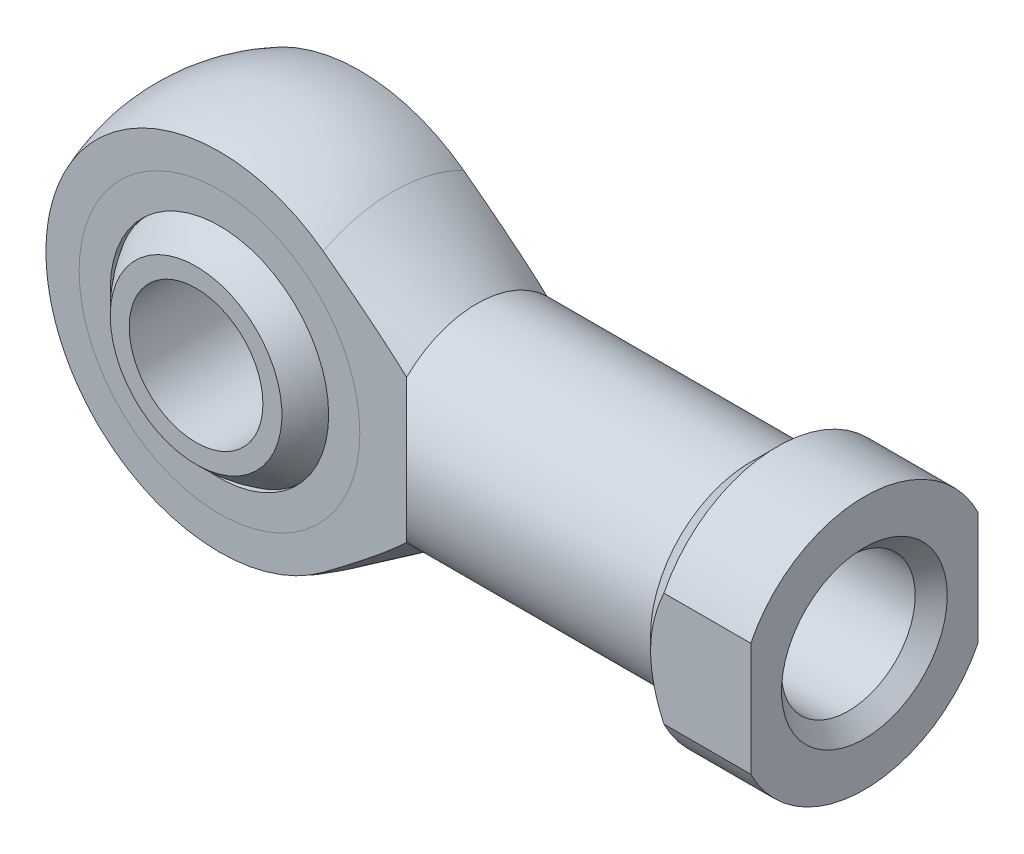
ISO-10303-21;
HEADER;
FILE_DESCRIPTION(('STEP AP214'),'2;1');
FILE_NAME('part.step','',(''),(''),'','','');
FILE_SCHEMA(('AUTOMOTIVE_DESIGN { 1 0 10303 214 1 1 1 1 }'));
ENDSEC;
DATA;
#1=APPLICATION_CONTEXT('core data for automotive mechanical design processes');
#2=APPLICATION_PROTOCOL_DEFINITION('international standard','automotive_design',2000,#1);
#3=PRODUCT_CONTEXT('',#1,'mechanical');
#4=PRODUCT('Part','Part','',(#3));
#5=PRODUCT_RELATED_PRODUCT_CATEGORY('part','',(#4));
#6=PRODUCT_DEFINITION_FORMATION('','',#4);
#7=PRODUCT_DEFINITION_CONTEXT('part definition',#1,'design');
#8=PRODUCT_DEFINITION('design','',#6,#7);
#9=PRODUCT_DEFINITION_SHAPE('','',#8);
#10=(LENGTH_UNIT() NAMED_UNIT(*) SI_UNIT(.MILLI.,.METRE.));
#11=(NAMED_UNIT(*) PLANE_ANGLE_UNIT() SI_UNIT($,.RADIAN.));
#12=(NAMED_UNIT(*) SI_UNIT($,.STERADIAN.) SOLID_ANGLE_UNIT());
#13=UNCERTAINTY_MEASURE_WITH_UNIT(LENGTH_MEASURE(1.E-05),#10,'distance_accuracy_value','');
#14=(GEOMETRIC_REPRESENTATION_CONTEXT(3) GLOBAL_UNCERTAINTY_ASSIGNED_CONTEXT((#13)) GLOBAL_UNIT_ASSIGNED_CONTEXT((#10,
#11,#12)) REPRESENTATION_CONTEXT('',''));
#15=CARTESIAN_POINT('',(0.,0.,0.));
#16=DIRECTION('',(0.,0.,1.));
#17=DIRECTION('',(1.,0.,0.));
#18=AXIS2_PLACEMENT_3D('',#15,#16,#17);
#19=CARTESIAN_POINT('',(0.,0.,0.));
#20=DIRECTION('',(0.,1.,0.));
#21=DIRECTION('',(1.,0.,0.));
#22=AXIS2_PLACEMENT_3D('',#19,#20,#21);
#23=SPHERICAL_SURFACE('',#22,9.5);
#24=CARTESIAN_POINT('',(0.,0.,0.));
#25=DIRECTION('',(0.,0.,-1.));
#26=DIRECTION('',(-1.,0.,0.));
#27=AXIS2_PLACEMENT_3D('',#24,#25,#26);
#28=SPHERICAL_SURFACE('',#27,9.5);
#29=CARTESIAN_POINT('',(0.,0.,7.));
#30=DIRECTION('',(0.,0.,-1.));
#31=DIRECTION('',(-1.,0.,0.));
#32=AXIS2_PLACEMENT_3D('',#29,#30,#31);
#33=CIRCLE('',#32,6.42261628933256);
#34=CARTESIAN_POINT('',(-6.42261628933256,0.,7.));
#35=VERTEX_POINT('',#34);
#36=EDGE_CURVE('P0_E26',#35,#35,#33,.F.);
#37=ORIENTED_EDGE('',*,*,#36,.F.);
#38=EDGE_LOOP('',(#37));
#39=FACE_BOUND('',#38,.T.);
#40=CARTESIAN_POINT('',(0.,0.,-7.));
#41=DIRECTION('',(0.,0.,1.));
#42=DIRECTION('',(1.,0.,0.));
#43=AXIS2_PLACEMENT_3D('',#40,#41,#42);
#44=CIRCLE('',#43,6.42261628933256);
#45=CARTESIAN_POINT('',(6.42261628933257,0.,-7.));
#46=VERTEX_POINT('',#45);
#47=EDGE_CURVE('P0_E10',#46,#46,#44,.F.);
#48=ORIENTED_EDGE('',*,*,#47,.F.);
#49=EDGE_LOOP('',(#48));
#50=FACE_BOUND('',#49,.T.);
#51=ADVANCED_FACE('P0_F14',(#39,#50),#28,.T.);
#52=CARTESIAN_POINT('',(0.,0.,-9.5));
#53=DIRECTION('',(0.,0.,1.));
#54=DIRECTION('',(1.,0.,0.));
#55=AXIS2_PLACEMENT_3D('',#52,#53,#54);
#56=CYLINDRICAL_SURFACE('',#55,5.);
#57=CARTESIAN_POINT('',(0.,0.,7.));
#58=DIRECTION('',(0.,0.,-1.));
#59=DIRECTION('',(-1.,0.,0.));
#60=AXIS2_PLACEMENT_3D('',#57,#58,#59);
#61=CIRCLE('',#60,5.);
#62=CARTESIAN_POINT('',(-5.,0.,7.));
#63=VERTEX_POINT('',#62);
#64=EDGE_CURVE('P0_E17',#63,#63,#61,.F.);
#65=ORIENTED_EDGE('',*,*,#64,.T.);
#66=EDGE_LOOP('',(#65));
#67=FACE_BOUND('',#66,.T.);
#68=CARTESIAN_POINT('',(0.,0.,-7.));
#69=DIRECTION('',(0.,0.,1.));
#70=DIRECTION('',(1.,0.,0.));
#71=AXIS2_PLACEMENT_3D('',#68,#69,#70);
#72=CIRCLE('',#71,5.);
#73=CARTESIAN_POINT('',(5.,0.,-7.));
#74=VERTEX_POINT('',#73);
#75=EDGE_CURVE('P0_E21',#74,#74,#72,.F.);
#76=ORIENTED_EDGE('',*,*,#75,.T.);
#77=EDGE_LOOP('',(#76));
#78=FACE_BOUND('',#77,.T.);
#79=ADVANCED_FACE('P0_F34',(#67,#78),#56,.F.);
#80=CARTESIAN_POINT('',(-9.5,-9.5,-7.));
#81=DIRECTION('',(0.,0.,1.));
#82=DIRECTION('',(1.,0.,0.));
#83=AXIS2_PLACEMENT_3D('',#80,#81,#82);
#84=PLANE('',#83);
#85=ORIENTED_EDGE('',*,*,#47,.T.);
#86=EDGE_LOOP('',(#85));
#87=FACE_BOUND('',#86,.T.);
#88=ORIENTED_EDGE('',*,*,#75,.F.);
#89=EDGE_LOOP('',(#88));
#90=FACE_BOUND('',#89,.T.);
#91=ADVANCED_FACE('P0_F39',(#87,#90),#84,.F.);
#92=CARTESIAN_POINT('',(-9.5,-9.5,7.));
#93=DIRECTION('',(0.,0.,-1.));
#94=DIRECTION('',(-1.,0.,0.));
#95=AXIS2_PLACEMENT_3D('',#92,#93,#94);
#96=PLANE('',#95);
#97=ORIENTED_EDGE('',*,*,#36,.T.);
#98=EDGE_LOOP('',(#97));
#99=FACE_BOUND('',#98,.T.);
#100=ORIENTED_EDGE('',*,*,#64,.F.);
#101=EDGE_LOOP('',(#100));
#102=FACE_BOUND('',#101,.T.);
#103=ADVANCED_FACE('P0_F37',(#99,#102),#96,.F.);
#104=CLOSED_SHELL('',(#51,#79,#91,#103));
#105=MANIFOLD_SOLID_BREP('P0_B1',#104);
#106=CARTESIAN_POINT('',(0.,0.,5.25));
#107=DIRECTION('',(0.,0.,1.));
#108=DIRECTION('',(1.,0.,0.));
#109=AXIS2_PLACEMENT_3D('',#106,#107,#108);
#110=PLANE('',#109);
#111=CARTESIAN_POINT('',(0.,0.,5.25));
#112=DIRECTION('',(0.,0.,1.));
#113=DIRECTION('',(1.,0.,0.));
#114=AXIS2_PLACEMENT_3D('',#111,#112,#113);
#115=CIRCLE('',#114,10.5);
#116=CARTESIAN_POINT('',(10.5,0.,5.25));
#117=VERTEX_POINT('',#116);
#118=EDGE_CURVE('P1_E10',#117,#117,#115,.T.);
#119=ORIENTED_EDGE('',*,*,#118,.T.);
#120=EDGE_LOOP('',(#119));
#121=FACE_BOUND('',#120,.T.);
#122=CARTESIAN_POINT('',(0.,0.,5.25));
#123=DIRECTION('',(0.,0.,1.));
#124=DIRECTION('',(1.,0.,0.));
#125=AXIS2_PLACEMENT_3D('',#122,#123,#124);
#126=CIRCLE('',#125,8.17);
#127=CARTESIAN_POINT('',(8.17,0.,5.25));
#128=VERTEX_POINT('',#127);
#129=EDGE_CURVE('P1_E25',#128,#128,#126,.T.);
#130=ORIENTED_EDGE('',*,*,#129,.F.);
#131=EDGE_LOOP('',(#130));
#132=FACE_BOUND('',#131,.T.);
#133=ADVANCED_FACE('P1_F14',(#121,#132),#110,.T.);
#134=CARTESIAN_POINT('',(0.,0.,4.85));
#135=DIRECTION('',(0.,0.,1.));
#136=DIRECTION('',(1.,0.,0.));
#137=AXIS2_PLACEMENT_3D('',#134,#135,#136);
#138=PLANE('',#137);
#139=CARTESIAN_POINT('',(0.,0.,4.85));
#140=DIRECTION('',(0.,0.,1.));
#141=DIRECTION('',(1.,0.,0.));
#142=AXIS2_PLACEMENT_3D('',#139,#140,#141);
#143=CIRCLE('',#142,10.5);
#144=CARTESIAN_POINT('',(10.5,0.,4.85));
#145=VERTEX_POINT('',#144);
#146=EDGE_CURVE('P1_E18',#145,#145,#143,.T.);
#147=ORIENTED_EDGE('',*,*,#146,.F.);
#148=EDGE_LOOP('',(#147));
#149=FACE_BOUND('',#148,.T.);
#150=CARTESIAN_POINT('',(0.,0.,4.85));
#151=DIRECTION('',(0.,0.,1.));
#152=DIRECTION('',(1.,0.,0.));
#153=AXIS2_PLACEMENT_3D('',#150,#151,#152);
#154=CIRCLE('',#153,8.17);
#155=CARTESIAN_POINT('',(8.17,0.,4.85));
#156=VERTEX_POINT('',#155);
#157=EDGE_CURVE('P1_E27',#156,#156,#154,.T.);
#158=ORIENTED_EDGE('',*,*,#157,.T.);
#159=EDGE_LOOP('',(#158));
#160=FACE_BOUND('',#159,.T.);
#161=ADVANCED_FACE('P1_F37',(#149,#160),#138,.F.);
#162=CARTESIAN_POINT('',(0.,0.,5.25));
#163=DIRECTION('',(0.,0.,-1.));
#164=DIRECTION('',(-1.,0.,0.));
#165=AXIS2_PLACEMENT_3D('',#162,#163,#164);
#166=CYLINDRICAL_SURFACE('',#165,10.5);
#167=ORIENTED_EDGE('',*,*,#118,.F.);
#168=EDGE_LOOP('',(#167));
#169=FACE_BOUND('',#168,.T.);
#170=ORIENTED_EDGE('',*,*,#146,.T.);
#171=EDGE_LOOP('',(#170));
#172=FACE_BOUND('',#171,.T.);
#173=ADVANCED_FACE('P1_F16',(#169,#172),#166,.T.);
#174=CARTESIAN_POINT('',(0.,0.,5.25));
#175=DIRECTION('',(0.,0.,-1.));
#176=DIRECTION('',(-1.,0.,0.));
#177=AXIS2_PLACEMENT_3D('',#174,#175,#176);
#178=CYLINDRICAL_SURFACE('',#177,8.17);
#179=ORIENTED_EDGE('',*,*,#129,.T.);
#180=EDGE_LOOP('',(#179));
#181=FACE_BOUND('',#180,.T.);
#182=ORIENTED_EDGE('',*,*,#157,.F.);
#183=EDGE_LOOP('',(#182));
#184=FACE_BOUND('',#183,.T.);
#185=ADVANCED_FACE('P1_F33',(#181,#184),#178,.F.);
#186=CLOSED_SHELL('',(#133,#161,#173,#185));
#187=MANIFOLD_SOLID_BREP('P1_B1',#186);
#188=CARTESIAN_POINT('',(0.,0.,-4.85));
#189=DIRECTION('',(0.,0.,1.));
#190=DIRECTION('',(1.,0.,0.));
#191=AXIS2_PLACEMENT_3D('',#188,#189,#190);
#192=PLANE('',#191);
#193=CARTESIAN_POINT('',(0.,0.,-4.85));
#194=DIRECTION('',(0.,0.,1.));
#195=DIRECTION('',(1.,0.,0.));
#196=AXIS2_PLACEMENT_3D('',#193,#194,#195);
#197=CIRCLE('',#196,10.5);
#198=CARTESIAN_POINT('',(10.5,0.,-4.85));
#199=VERTEX_POINT('',#198);
#200=EDGE_CURVE('P2_E10',#199,#199,#197,.T.);
#201=ORIENTED_EDGE('',*,*,#200,.T.);
#202=EDGE_LOOP('',(#201));
#203=FACE_BOUND('',#202,.T.);
#204=CARTESIAN_POINT('',(0.,0.,-4.85));
#205=DIRECTION('',(0.,0.,1.));
#206=DIRECTION('',(1.,0.,0.));
#207=AXIS2_PLACEMENT_3D('',#204,#205,#206);
#208=CIRCLE('',#207,8.17);
#209=CARTESIAN_POINT('',(8.17,0.,-4.85));
#210=VERTEX_POINT('',#209);
#211=EDGE_CURVE('P2_E25',#210,#210,#208,.T.);
#212=ORIENTED_EDGE('',*,*,#211,.F.);
#213=EDGE_LOOP('',(#212));
#214=FACE_BOUND('',#213,.T.);
#215=ADVANCED_FACE('P2_F14',(#203,#214),#192,.T.);
#216=CARTESIAN_POINT('',(0.,0.,-5.25));
#217=DIRECTION('',(0.,0.,1.));
#218=DIRECTION('',(1.,0.,0.));
#219=AXIS2_PLACEMENT_3D('',#216,#217,#218);
#220=PLANE('',#219);
#221=CARTESIAN_POINT('',(0.,0.,-5.25));
#222=DIRECTION('',(0.,0.,1.));
#223=DIRECTION('',(1.,0.,0.));
#224=AXIS2_PLACEMENT_3D('',#221,#222,#223);
#225=CIRCLE('',#224,10.5);
#226=CARTESIAN_POINT('',(10.5,0.,-5.25));
#227=VERTEX_POINT('',#226);
#228=EDGE_CURVE('P2_E18',#227,#227,#225,.T.);
#229=ORIENTED_EDGE('',*,*,#228,.F.);
#230=EDGE_LOOP('',(#229));
#231=FACE_BOUND('',#230,.T.);
#232=CARTESIAN_POINT('',(0.,0.,-5.25));
#233=DIRECTION('',(0.,0.,1.));
#234=DIRECTION('',(1.,0.,0.));
#235=AXIS2_PLACEMENT_3D('',#232,#233,#234);
#236=CIRCLE('',#235,8.17);
#237=CARTESIAN_POINT('',(8.17,0.,-5.25));
#238=VERTEX_POINT('',#237);
#239=EDGE_CURVE('P2_E27',#238,#238,#236,.T.);
#240=ORIENTED_EDGE('',*,*,#239,.T.);
#241=EDGE_LOOP('',(#240));
#242=FACE_BOUND('',#241,.T.);
#243=ADVANCED_FACE('P2_F37',(#231,#242),#220,.F.);
#244=CARTESIAN_POINT('',(0.,0.,-4.85));
#245=DIRECTION('',(0.,0.,-1.));
#246=DIRECTION('',(-1.,0.,0.));
#247=AXIS2_PLACEMENT_3D('',#244,#245,#246);
#248=CYLINDRICAL_SURFACE('',#247,10.5);
#249=ORIENTED_EDGE('',*,*,#200,.F.);
#250=EDGE_LOOP('',(#249));
#251=FACE_BOUND('',#250,.T.);
#252=ORIENTED_EDGE('',*,*,#228,.T.);
#253=EDGE_LOOP('',(#252));
#254=FACE_BOUND('',#253,.T.);
#255=ADVANCED_FACE('P2_F16',(#251,#254),#248,.T.);
#256=CARTESIAN_POINT('',(0.,0.,-4.85));
#257=DIRECTION('',(0.,0.,-1.));
#258=DIRECTION('',(-1.,0.,0.));
#259=AXIS2_PLACEMENT_3D('',#256,#257,#258);
#260=CYLINDRICAL_SURFACE('',#259,8.17);
#261=ORIENTED_EDGE('',*,*,#211,.T.);
#262=EDGE_LOOP('',(#261));
#263=FACE_BOUND('',#262,.T.);
#264=ORIENTED_EDGE('',*,*,#239,.F.);
#265=EDGE_LOOP('',(#264));
#266=FACE_BOUND('',#265,.T.);
#267=ADVANCED_FACE('P2_F33',(#263,#266),#260,.F.);
#268=CLOSED_SHELL('',(#215,#243,#255,#267));
#269=MANIFOLD_SOLID_BREP('P2_B1',#268);
#270=CARTESIAN_POINT('',(0.,0.,0.));
#271=DIRECTION('',(0.,1.,0.));
#272=DIRECTION('',(1.,0.,0.));
#273=AXIS2_PLACEMENT_3D('',#270,#271,#272);
#274=SPHERICAL_SURFACE('',#273,9.5);
#275=CARTESIAN_POINT('',(0.,0.,0.));
#276=DIRECTION('',(0.,0.,1.));
#277=DIRECTION('',(1.,0.,0.));
#278=AXIS2_PLACEMENT_3D('',#275,#276,#277);
#279=SPHERICAL_SURFACE('',#278,9.5);
#280=CARTESIAN_POINT('',(0.,0.,4.85));
#281=DIRECTION('',(0.,0.,1.));
#282=DIRECTION('',(1.,0.,0.));
#283=AXIS2_PLACEMENT_3D('',#280,#281,#282);
#284=CIRCLE('',#283,8.16869022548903);
#285=CARTESIAN_POINT('',(8.16869022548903,0.,4.85));
#286=VERTEX_POINT('',#285);
#287=EDGE_CURVE('P3_E73',#286,#286,#284,.F.);
#288=ORIENTED_EDGE('',*,*,#287,.F.);
#289=EDGE_LOOP('',(#288));
#290=FACE_BOUND('',#289,.T.);
#291=CARTESIAN_POINT('',(0.,0.,-4.85));
#292=DIRECTION('',(0.,0.,-1.));
#293=DIRECTION('',(-1.,0.,0.));
#294=AXIS2_PLACEMENT_3D('',#291,#292,#293);
#295=CIRCLE('',#294,8.16869022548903);
#296=CARTESIAN_POINT('',(-8.16869022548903,0.,-4.85));
#297=VERTEX_POINT('',#296);
#298=EDGE_CURVE('P3_E20',#297,#297,#295,.F.);
#299=ORIENTED_EDGE('',*,*,#298,.F.);
#300=EDGE_LOOP('',(#299));
#301=FACE_BOUND('',#300,.T.);
#302=ADVANCED_FACE('P3_F16',(#290,#301),#279,.F.);
#303=CARTESIAN_POINT('',(-14.,-14.,-5.25));
#304=DIRECTION('',(0.,0.,1.));
#305=DIRECTION('',(1.,0.,0.));
#306=AXIS2_PLACEMENT_3D('',#303,#304,#305);
#307=PLANE('',#306);
#308=CARTESIAN_POINT('',(0.,0.,-5.25));
#309=DIRECTION('',(0.,0.,1.));
#310=DIRECTION('',(1.,0.,0.));
#311=AXIS2_PLACEMENT_3D('',#308,#309,#310);
#312=CIRCLE('',#311,12.9783473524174);
#313=CARTESIAN_POINT('',(7.7561942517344,10.4057172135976,-5.25));
#314=VERTEX_POINT('',#313);
#315=CARTESIAN_POINT('',(7.7561942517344,-10.4057172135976,-5.25));
#316=VERTEX_POINT('',#315);
#317=EDGE_CURVE('P3_E11',#314,#316,#312,.T.);
#318=ORIENTED_EDGE('',*,*,#317,.F.);
#319=CARTESIAN_POINT('',(-26.1731525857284,-33.8293244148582,-5.25));
#320=CARTESIAN_POINT('',(-25.2933000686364,-33.2367889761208,-5.25));
#321=CARTESIAN_POINT('',(-24.4136121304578,-32.6440089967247,-5.25));
#322=CARTESIAN_POINT('',(-22.6546328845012,-31.4578535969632,-5.25));
#323=CARTESIAN_POINT('',(-21.7753415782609,-30.8644781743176,-5.25));
#324=CARTESIAN_POINT('',(-20.0159779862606,-29.6761845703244,-5.25));
#325=CARTESIAN_POINT('',(-19.1359063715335,-29.081265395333,-5.25));
#326=CARTESIAN_POINT('',(-17.3763334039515,-27.8905909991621,-5.25));
#327=CARTESIAN_POINT('',(-16.4968320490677,-27.2948357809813,-5.25));
#328=CARTESIAN_POINT('',(-14.716941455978,-26.087678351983,-5.25));
#329=CARTESIAN_POINT('',(-13.8165692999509,-25.4762509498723,-5.25));
#330=CARTESIAN_POINT('',(-12.016717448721,-24.2520840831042,-5.25));
#331=CARTESIAN_POINT('',(-11.1172377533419,-23.6393446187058,-5.25));
#332=CARTESIAN_POINT('',(-9.3206592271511,-22.4130819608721,-5.25));
#333=CARTESIAN_POINT('',(-8.42355882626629,-21.7995610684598,-5.25));
#334=CARTESIAN_POINT('',(-6.63082526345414,-20.5704528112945,-5.25));
#335=CARTESIAN_POINT('',(-5.7351920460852,-19.9548655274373,-5.25));
#336=CARTESIAN_POINT('',(-3.94786846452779,-18.7223929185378,-5.25));
#337=CARTESIAN_POINT('',(-3.05617377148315,-18.1055138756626,-5.25));
#338=CARTESIAN_POINT('',(-1.27517466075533,-16.8680398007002,-5.25));
#339=CARTESIAN_POINT('',(-0.38587060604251,-16.2474442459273,-5.25));
#340=CARTESIAN_POINT('',(1.39312632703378,-14.9985356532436,-5.25));
#341=CARTESIAN_POINT('',(2.28280387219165,-14.3702007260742,-5.25));
#342=CARTESIAN_POINT('',(3.61319973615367,-13.4223939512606,-5.25));
#343=CARTESIAN_POINT('',(4.05586544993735,-13.1056560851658,-5.25));
#344=CARTESIAN_POINT('',(4.93957807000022,-12.4699382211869,-5.25));
#345=CARTESIAN_POINT('',(5.38062499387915,-12.15095824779,-5.25));
#346=CARTESIAN_POINT('',(6.25418906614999,-11.5149523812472,-5.25));
#347=CARTESIAN_POINT('',(6.68673591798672,-11.1979673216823,-5.25));
#348=CARTESIAN_POINT('',(7.54931828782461,-10.5605992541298,-5.25));
#349=CARTESIAN_POINT('',(7.97935382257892,-10.2402162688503,-5.25));
#350=CARTESIAN_POINT('',(8.83700875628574,-9.59443300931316,-5.25));
#351=CARTESIAN_POINT('',(9.26462151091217,-9.26902389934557,-5.25));
#352=CARTESIAN_POINT('',(10.115364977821,-8.61249883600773,-5.25));
#353=CARTESIAN_POINT('',(10.5384963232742,-8.28138370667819,-5.25));
#354=CARTESIAN_POINT('',(11.1667713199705,-7.78025787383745,-5.25));
#355=CARTESIAN_POINT('',(11.3742618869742,-7.61318950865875,-5.25));
#356=CARTESIAN_POINT('',(11.7873923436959,-7.27678210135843,-5.25));
#357=CARTESIAN_POINT('',(11.9930322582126,-7.10744308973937,-5.25));
#358=CARTESIAN_POINT('',(12.4021947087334,-6.76596294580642,-5.25));
#359=CARTESIAN_POINT('',(12.6057158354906,-6.59382012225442,-5.25));
#360=CARTESIAN_POINT('',(13.0099741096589,-6.24629938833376,-5.25));
#361=CARTESIAN_POINT('',(13.2107113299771,-6.07092156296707,-5.25));
#362=CARTESIAN_POINT('',(13.6079956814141,-5.71685427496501,-5.25));
#363=CARTESIAN_POINT('',(13.8045550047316,-5.53817852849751,-5.25));
#364=CARTESIAN_POINT('',(14.1932497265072,-5.17600968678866,-5.25));
#365=CARTESIAN_POINT('',(14.3853845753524,-4.99251599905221,-5.25));
#366=CARTESIAN_POINT('',(14.7635894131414,-4.61977773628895,-5.25));
#367=CARTESIAN_POINT('',(14.9496659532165,-4.43053983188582,-5.25));
#368=CARTESIAN_POINT('',(15.3139080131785,-4.04462781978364,-5.25));
#369=CARTESIAN_POINT('',(15.4920761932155,-3.84795625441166,-5.25));
#370=CARTESIAN_POINT('',(15.7271784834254,-3.57368424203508,-5.25));
#371=CARTESIAN_POINT('',(15.7889194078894,-3.50019306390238,-5.25));
#372=CARTESIAN_POINT('',(15.9107548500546,-3.35183673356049,-5.25));
#373=CARTESIAN_POINT('',(15.9708491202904,-3.27697137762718,-5.25));
#374=CARTESIAN_POINT('',(16.0891754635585,-3.12572344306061,-5.25));
#375=CARTESIAN_POINT('',(16.1474066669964,-3.04934018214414,-5.25));
#376=CARTESIAN_POINT('',(16.2616894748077,-2.894965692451,-5.25));
#377=CARTESIAN_POINT('',(16.3177411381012,-2.81697450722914,-5.25));
#378=CARTESIAN_POINT('',(16.4816538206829,-2.58110326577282,-5.25));
#379=CARTESIAN_POINT('',(16.5858301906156,-2.42062236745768,-5.25));
#380=CARTESIAN_POINT('',(16.7809249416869,-2.09178345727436,-5.25));
#381=CARTESIAN_POINT('',(16.8718520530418,-1.92343072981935,-5.25));
#382=CARTESIAN_POINT('',(17.0016286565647,-1.65043253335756,-5.25));
#383=CARTESIAN_POINT('',(17.0463570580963,-1.54858037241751,-5.25));
#384=CARTESIAN_POINT('',(17.1287343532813,-1.34203969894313,-5.25));
#385=CARTESIAN_POINT('',(17.1663842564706,-1.23735159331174,-5.25));
#386=CARTESIAN_POINT('',(17.2334747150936,-1.02540649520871,-5.25));
#387=CARTESIAN_POINT('',(17.2629190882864,-0.918150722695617,-5.25));
#388=CARTESIAN_POINT('',(17.3125428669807,-0.701522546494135,-5.25));
#389=CARTESIAN_POINT('',(17.3327247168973,-0.592150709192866,-5.25));
#390=CARTESIAN_POINT('',(17.3631273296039,-0.370871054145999,-5.25));
#391=CARTESIAN_POINT('',(17.3732439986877,-0.258948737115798,-5.25));
#392=CARTESIAN_POINT('',(17.382664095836,-0.0346517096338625,-5.25));
#393=CARTESIAN_POINT('',(17.3819682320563,0.0777229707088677,-5.25));
#394=CARTESIAN_POINT('',(17.3697993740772,0.301875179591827,-5.25));
#395=CARTESIAN_POINT('',(17.358326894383,0.413652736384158,-5.25));
#396=CARTESIAN_POINT('',(17.3251542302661,0.635674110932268,-5.25));
#397=CARTESIAN_POINT('',(17.3034523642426,0.745917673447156,-5.25));
#398=CARTESIAN_POINT('',(17.2453182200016,0.986586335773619,-5.25));
#399=CARTESIAN_POINT('',(17.2067745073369,1.11649962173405,-5.25));
#400=CARTESIAN_POINT('',(17.1181173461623,1.37233134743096,-5.25));
#401=CARTESIAN_POINT('',(17.0679971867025,1.49824742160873,-5.25));
#402=CARTESIAN_POINT('',(16.9580397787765,1.74614052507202,-5.25));
#403=CARTESIAN_POINT('',(16.8981756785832,1.86810551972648,-5.25));
#404=CARTESIAN_POINT('',(16.7706213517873,2.10780837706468,-5.25));
#405=CARTESIAN_POINT('',(16.7029321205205,2.22554677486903,-5.25));
#406=CARTESIAN_POINT('',(16.5320133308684,2.50481861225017,-5.25));
#407=CARTESIAN_POINT('',(16.4256292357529,2.66441485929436,-5.25));
#408=CARTESIAN_POINT('',(16.2033862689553,2.97690499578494,-5.25));
#409=CARTESIAN_POINT('',(16.0875222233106,3.12979515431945,-5.25));
#410=CARTESIAN_POINT('',(15.8483812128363,3.43015682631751,-5.25));
#411=CARTESIAN_POINT('',(15.7250890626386,3.57761617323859,-5.25));
#412=CARTESIAN_POINT('',(15.4729858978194,3.86765984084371,-5.25));
#413=CARTESIAN_POINT('',(15.3441759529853,4.01024509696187,-5.25));
#414=CARTESIAN_POINT('',(15.0812215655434,4.29239367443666,-5.25));
#415=CARTESIAN_POINT('',(14.9470444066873,4.43192638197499,-5.25));
#416=CARTESIAN_POINT('',(14.6751598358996,4.70750762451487,-5.25));
#417=CARTESIAN_POINT('',(14.5374522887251,4.84355602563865,-5.25));
#418=CARTESIAN_POINT('',(14.2593659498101,5.11251109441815,-5.25));
#419=CARTESIAN_POINT('',(14.118990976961,5.24542172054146,-5.25));
#420=CARTESIAN_POINT('',(13.8359027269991,5.50871311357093,-5.25));
#421=CARTESIAN_POINT('',(13.6931895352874,5.63909397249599,-5.25));
#422=CARTESIAN_POINT('',(13.3853959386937,5.91605754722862,-5.25));
#423=CARTESIAN_POINT('',(13.2200187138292,6.06231002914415,-5.25));
#424=CARTESIAN_POINT('',(12.8871676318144,6.35241192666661,-5.25));
#425=CARTESIAN_POINT('',(12.7196937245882,6.49626128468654,-5.25));
#426=CARTESIAN_POINT('',(12.2146361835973,6.92476807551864,-5.25));
#427=CARTESIAN_POINT('',(11.8744481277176,7.20635624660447,-5.25));
#428=CARTESIAN_POINT('',(11.1889901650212,7.76352126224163,-5.25));
#429=CARTESIAN_POINT('',(10.8437183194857,8.03909570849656,-5.25));
#430=CARTESIAN_POINT('',(10.1494640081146,8.58553871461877,-5.25));
#431=CARTESIAN_POINT('',(9.80048145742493,8.85640716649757,-5.25));
#432=CARTESIAN_POINT('',(9.09910313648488,9.39488755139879,-5.25));
#433=CARTESIAN_POINT('',(8.74670268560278,9.66249337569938,-5.25));
#434=CARTESIAN_POINT('',(8.03966492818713,10.1947384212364,-5.25));
#435=CARTESIAN_POINT('',(7.68502759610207,10.4593776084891,-5.25));
#436=CARTESIAN_POINT('',(6.97405475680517,10.9861789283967,-5.25));
#437=CARTESIAN_POINT('',(6.61771968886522,11.2483416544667,-5.25));
#438=CARTESIAN_POINT('',(5.90359408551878,11.770678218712,-5.25));
#439=CARTESIAN_POINT('',(5.54580354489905,12.0308520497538,-5.25));
#440=CARTESIAN_POINT('',(4.47400625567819,12.8064699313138,-5.25));
#441=CARTESIAN_POINT('',(3.75823409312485,13.3194741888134,-5.25));
#442=CARTESIAN_POINT('',(2.32332979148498,14.3408416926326,-5.25));
#443=CARTESIAN_POINT('',(1.60419745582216,14.8492046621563,-5.25));
#444=CARTESIAN_POINT('',(0.164159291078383,15.8619757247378,-5.25));
#445=CARTESIAN_POINT('',(-0.556744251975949,16.3663870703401,-5.25));
#446=CARTESIAN_POINT('',(-2.00038804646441,17.3725419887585,-5.25));
#447=CARTESIAN_POINT('',(-2.72312826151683,17.8742856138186,-5.25));
#448=CARTESIAN_POINT('',(-4.63297721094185,19.1961141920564,-5.25));
#449=CARTESIAN_POINT('',(-5.82129262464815,20.01445519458,-5.25));
#450=CARTESIAN_POINT('',(-8.20055828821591,21.647299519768,-5.25));
#451=CARTESIAN_POINT('',(-9.39150854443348,22.4618028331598,-5.25));
#452=CARTESIAN_POINT('',(-11.7753267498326,24.0880323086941,-5.25));
#453=CARTESIAN_POINT('',(-12.9681947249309,24.8997584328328,-5.25));
#454=CARTESIAN_POINT('',(-15.3553449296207,26.5211289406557,-5.25));
#455=CARTESIAN_POINT('',(-16.5496271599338,27.3307733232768,-5.25));
#456=CARTESIAN_POINT('',(-18.9397953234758,28.9488192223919,-5.25));
#457=CARTESIAN_POINT('',(-20.135681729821,29.757220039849,-5.25));
#458=CARTESIAN_POINT('',(-22.5283020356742,31.3727666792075,-5.25));
#459=CARTESIAN_POINT('',(-23.7250359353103,32.1799125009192,-5.25));
#460=CARTESIAN_POINT('',(-27.3162246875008,34.5998518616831,-5.25));
#461=CARTESIAN_POINT('',(-29.711681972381,36.2111576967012,-5.25));
#462=CARTESIAN_POINT('',(-34.5104462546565,39.4352298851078,-5.25));
#463=CARTESIAN_POINT('',(-36.9137577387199,41.0479895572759,-5.25));
#464=CARTESIAN_POINT('',(-41.7216327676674,44.2716521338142,-5.25));
#465=CARTESIAN_POINT('',(-44.1261963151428,45.8825550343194,-5.25));
#466=CARTESIAN_POINT('',(-48.935064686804,49.1022379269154,-5.25));
#467=CARTESIAN_POINT('',(-51.3393690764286,50.7110185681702,-5.25));
#468=CARTESIAN_POINT('',(-56.1486612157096,53.9275457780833,-5.25));
#469=CARTESIAN_POINT('',(-58.5536489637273,55.5352923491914,-5.25));
#470=CARTESIAN_POINT('',(-60.9588756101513,57.1426811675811,-5.25));
#471=B_SPLINE_CURVE_WITH_KNOTS('',3,(#319,#320,#321,#322,#323,#324,#325,#326,#327,#328,#329,
#330,#331,#332,#333,#334,#335,#336,#337,#338,#339,#340,#341,#342,#343,#344,#345,#346,#347,#348,
#349,#350,#351,#352,#353,#354,#355,#356,#357,#358,#359,#360,#361,#362,#363,#364,#365,#366,#367,
#368,#369,#370,#371,#372,#373,#374,#375,#376,#377,#378,#379,#380,#381,#382,#383,#384,#385,#386,
#387,#388,#389,#390,#391,#392,#393,#394,#395,#396,#397,#398,#399,#400,#401,#402,#403,#404,#405,
#406,#407,#408,#409,#410,#411,#412,#413,#414,#415,#416,#417,#418,#419,#420,#421,#422,#423,#424,
#425,#426,#427,#428,#429,#430,#431,#432,#433,#434,#435,#436,#437,#438,#439,#440,#441,#442,#443,
#444,#445,#446,#447,#448,#449,#450,#451,#452,#453,#454,#455,#456,#457,#458,#459,#460,#461,#462,
#463,#464,#465,#466,#467,#468,#469,#470),.UNSPECIFIED.,.F.,.F.,(4,2,2,2,2,2,2,2,2,2,2,2,2,2,2,2,
2,2,2,2,2,2,2,2,2,2,2,2,2,2,2,2,2,2,2,2,2,2,2,2,2,2,2,2,2,2,2,2,2,2,2,2,2,2,2,2,2,2,2,2,2,2,2,2,
2,2,2,2,2,2,2,2,2,2,2,4),(0.,3.18231815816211,6.36464854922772,9.55151084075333,12.738361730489,
16.0034215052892,19.2684806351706,22.5289649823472,25.7893231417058,29.0421507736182,
32.2954471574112,35.5629822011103,37.1959136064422,38.8288272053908,40.4375988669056,
42.0463597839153,43.6583738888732,45.2701571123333,46.0693176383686,46.8684674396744,
47.6681185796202,48.4677487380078,49.2645842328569,50.0615181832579,50.8575596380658,
51.6533312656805,51.9412638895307,52.2292395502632,52.5173477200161,52.805448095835,
53.3789608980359,53.9520940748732,54.2856004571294,54.6190592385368,54.9523626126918,
55.2855779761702,55.6222046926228,55.9588093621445,56.2953979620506,56.6320419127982,
57.0379131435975,57.4440202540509,57.85126604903,58.2584601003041,58.8333826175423,
59.4086210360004,59.9850781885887,60.5614240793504,61.1420846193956,61.7227674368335,
62.3026736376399,62.8825587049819,63.5448402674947,64.2071376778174,65.5318586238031,
66.8570985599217,68.1823688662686,69.5098252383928,70.8372968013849,72.1644417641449,
73.49159148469,76.1334408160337,78.7754466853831,81.4149830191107,84.054467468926,
88.3829628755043,92.7114687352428,97.0400335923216,101.36860065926,105.699062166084,
110.029524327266,118.690392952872,127.373254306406,136.056133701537,144.734825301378,
153.413496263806),.UNSPECIFIED.);
#472=CARTESIAN_POINT('',(14.,5.35607132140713,-5.25));
#473=VERTEX_POINT('',#472);
#474=EDGE_CURVE('P3_E102',#473,#314,#471,.T.);
#475=ORIENTED_EDGE('',*,*,#474,.F.);
#476=DIRECTION('',(0.,1.,0.));
#477=VECTOR('',#476,1.);
#478=CARTESIAN_POINT('',(14.,-14.,-5.25));
#479=LINE('',#478,#477);
#480=CARTESIAN_POINT('',(14.,-5.35607132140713,-5.25));
#481=VERTEX_POINT('',#480);
#482=EDGE_CURVE('P3_E64',#481,#473,#479,.T.);
#483=ORIENTED_EDGE('',*,*,#482,.F.);
#484=EDGE_CURVE('P3_E33',#316,#481,#471,.T.);
#485=ORIENTED_EDGE('',*,*,#484,.F.);
#486=EDGE_LOOP('',(#318,#475,#483,#485));
#487=FACE_BOUND('',#486,.T.);
#488=CARTESIAN_POINT('',(0.,0.,-5.25));
#489=DIRECTION('',(0.,0.,1.));
#490=DIRECTION('',(1.,0.,0.));
#491=AXIS2_PLACEMENT_3D('',#488,#489,#490);
#492=CIRCLE('',#491,10.5);
#493=CARTESIAN_POINT('',(10.5,0.,-5.25));
#494=VERTEX_POINT('',#493);
#495=EDGE_CURVE('P3_E95',#494,#494,#492,.T.);
#496=ORIENTED_EDGE('',*,*,#495,.T.);
#497=EDGE_LOOP('',(#496));
#498=FACE_BOUND('',#497,.T.);
#499=ADVANCED_FACE('P3_F125',(#487,#498),#307,.F.);
#500=CARTESIAN_POINT('',(14.,0.,0.));
#501=DIRECTION('',(-1.,0.,0.));
#502=DIRECTION('',(0.,0.,1.));
#503=AXIS2_PLACEMENT_3D('',#500,#501,#502);
#504=CONICAL_SURFACE('',#503,7.5,0.5871779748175);
#505=CARTESIAN_POINT('',(7.7561942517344,0.,0.));
#506=DIRECTION('',(-1.,0.,0.));
#507=DIRECTION('',(0.,0.,1.));
#508=AXIS2_PLACEMENT_3D('',#505,#506,#507);
#509=CIRCLE('',#508,11.6551040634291);
#510=CARTESIAN_POINT('',(7.7561942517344,-10.4057172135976,5.25));
#511=VERTEX_POINT('',#510);
#512=EDGE_CURVE('P3_E79',#316,#511,#509,.T.);
#513=ORIENTED_EDGE('',*,*,#512,.F.);
#514=ORIENTED_EDGE('',*,*,#484,.T.);
#515=CARTESIAN_POINT('',(14.,0.,0.));
#516=DIRECTION('',(-1.,0.,0.));
#517=DIRECTION('',(0.,0.,1.));
#518=AXIS2_PLACEMENT_3D('',#515,#516,#517);
#519=CIRCLE('',#518,7.5);
#520=CARTESIAN_POINT('',(14.,-5.35607132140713,5.25));
#521=VERTEX_POINT('',#520);
#522=EDGE_CURVE('P3_E70',#481,#521,#519,.T.);
#523=ORIENTED_EDGE('',*,*,#522,.T.);
#524=CARTESIAN_POINT('',(-25.9816265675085,-33.7003368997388,5.25));
#525=CARTESIAN_POINT('',(-25.1053778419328,-33.1101751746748,5.25));
#526=CARTESIAN_POINT('',(-24.2292942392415,-32.5197681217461,5.25));
#527=CARTESIAN_POINT('',(-22.4775249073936,-31.3383566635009,5.25));
#528=CARTESIAN_POINT('',(-21.6018391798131,-30.7473522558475,5.25));
#529=CARTESIAN_POINT('',(-19.8496674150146,-29.5637843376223,5.25));
#530=CARTESIAN_POINT('',(-18.9731820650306,-28.9712198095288,5.25));
#531=CARTESIAN_POINT('',(-17.220783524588,-27.785252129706,5.25));
#532=CARTESIAN_POINT('',(-16.3448703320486,-27.1918489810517,5.25));
#533=CARTESIAN_POINT('',(-14.5716215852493,-25.98902648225,5.25));
#534=CARTESIAN_POINT('',(-13.6743036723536,-25.3795811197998,5.25));
#535=CARTESIAN_POINT('',(-11.880564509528,-24.1593723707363,5.25));
#536=CARTESIAN_POINT('',(-10.9841432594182,-23.5486089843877,5.25));
#537=CARTESIAN_POINT('',(-9.19370952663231,-22.326306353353,5.25));
#538=CARTESIAN_POINT('',(-8.29969543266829,-21.7147694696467,5.25));
#539=CARTESIAN_POINT('',(-6.51314221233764,-20.4896198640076,5.25));
#540=CARTESIAN_POINT('',(-5.6206030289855,-19.8760072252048,5.25));
#541=CARTESIAN_POINT('',(-3.83951132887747,-18.6474947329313,5.25));
#542=CARTESIAN_POINT('',(-2.95095437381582,-18.0326013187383,5.25));
#543=CARTESIAN_POINT('',(-1.17624146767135,-16.7990789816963,5.25));
#544=CARTESIAN_POINT('',(-0.29008588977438,-16.1804495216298,5.25));
#545=CARTESIAN_POINT('',(1.48266488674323,-14.9353973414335,5.25));
#546=CARTESIAN_POINT('',(2.36924433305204,-14.3089521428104,5.25));
#547=CARTESIAN_POINT('',(3.69496476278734,-13.3639526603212,5.25));
#548=CARTESIAN_POINT('',(4.13606510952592,-13.0481476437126,5.25));
#549=CARTESIAN_POINT('',(5.01663658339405,-12.4142826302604,5.25));
#550=CARTESIAN_POINT('',(5.45610772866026,-12.0962226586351,5.25));
#551=CARTESIAN_POINT('',(6.32630973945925,-11.4621872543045,5.25));
#552=CARTESIAN_POINT('',(6.75707151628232,-11.1462542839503,5.25));
#553=CARTESIAN_POINT('',(7.61606881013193,-10.5109732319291,5.25));
#554=CARTESIAN_POINT('',(8.04430434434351,-10.1916251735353,5.25));
#555=CARTESIAN_POINT('',(8.89835474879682,-9.54787636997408,5.25));
#556=CARTESIAN_POINT('',(9.32416278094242,-9.22346654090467,5.25));
#557=CARTESIAN_POINT('',(10.17126594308,-8.56890953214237,5.25));
#558=CARTESIAN_POINT('',(10.5925617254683,-8.2387632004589,5.25));
#559=CARTESIAN_POINT('',(11.2180199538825,-7.73908326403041,5.25));
#560=CARTESIAN_POINT('',(11.4245466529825,-7.57250898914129,5.25));
#561=CARTESIAN_POINT('',(11.8357360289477,-7.23707753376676,5.25));
#562=CARTESIAN_POINT('',(12.0403987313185,-7.0682203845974,5.25));
#563=CARTESIAN_POINT('',(12.4475922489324,-6.72768700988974,5.25));
#564=CARTESIAN_POINT('',(12.6501216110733,-6.55600904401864,5.25));
#565=CARTESIAN_POINT('',(13.0523742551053,-6.20940003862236,5.25));
#566=CARTESIAN_POINT('',(13.2520976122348,-6.03446908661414,5.25));
#567=CARTESIAN_POINT('',(13.6473130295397,-5.68128584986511,5.25));
#568=CARTESIAN_POINT('',(13.8428176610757,-5.5030476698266,5.25));
#569=CARTESIAN_POINT('',(14.2293650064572,-5.14172720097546,5.25));
#570=CARTESIAN_POINT('',(14.4204071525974,-4.9586443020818,5.25));
#571=CARTESIAN_POINT('',(14.796369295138,-4.58670007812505,5.25));
#572=CARTESIAN_POINT('',(14.9812960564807,-4.39784561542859,5.25));
#573=CARTESIAN_POINT('',(15.3431620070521,-4.01266367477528,5.25));
#574=CARTESIAN_POINT('',(15.5201039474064,-3.81633881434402,5.25));
#575=CARTESIAN_POINT('',(15.7528832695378,-3.54318896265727,5.25));
#576=CARTESIAN_POINT('',(15.8135896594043,-3.47050187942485,5.25));
#577=CARTESIAN_POINT('',(15.9333720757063,-3.32377487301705,5.25));
#578=CARTESIAN_POINT('',(15.9924478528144,-3.24973474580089,5.25));
#579=CARTESIAN_POINT('',(16.1087568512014,-3.1001633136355,5.25));
#580=CARTESIAN_POINT('',(16.1659892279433,-3.02463135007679,5.25));
#581=CARTESIAN_POINT('',(16.2783012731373,-2.87198904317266,5.25));
#582=CARTESIAN_POINT('',(16.3333810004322,-2.79487874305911,5.25));
#583=CARTESIAN_POINT('',(16.4944485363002,-2.56167841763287,5.25));
#584=CARTESIAN_POINT('',(16.596801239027,-2.40303823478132,5.25));
#585=CARTESIAN_POINT('',(16.7884750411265,-2.07805936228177,5.25));
#586=CARTESIAN_POINT('',(16.8778043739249,-1.91172562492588,5.25));
#587=CARTESIAN_POINT('',(17.0059487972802,-1.64082694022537,5.25));
#588=CARTESIAN_POINT('',(17.050443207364,-1.53894751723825,5.25));
#589=CARTESIAN_POINT('',(17.1323270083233,-1.33236002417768,5.25));
#590=CARTESIAN_POINT('',(17.1697174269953,-1.22765236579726,5.25));
#591=CARTESIAN_POINT('',(17.2362651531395,-1.01568192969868,5.25));
#592=CARTESIAN_POINT('',(17.2654262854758,-0.908420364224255,5.25));
#593=CARTESIAN_POINT('',(17.3144656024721,-0.691801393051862,5.25));
#594=CARTESIAN_POINT('',(17.3343462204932,-0.582444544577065,5.25));
#595=CARTESIAN_POINT('',(17.3641337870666,-0.361236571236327,5.25));
#596=CARTESIAN_POINT('',(17.3739379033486,-0.249371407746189,5.25));
#597=CARTESIAN_POINT('',(17.3827428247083,-0.0252186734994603,5.25));
#598=CARTESIAN_POINT('',(17.3817443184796,0.0870688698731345,5.25));
#599=CARTESIAN_POINT('',(17.3689949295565,0.31102146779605,5.25));
#600=CARTESIAN_POINT('',(17.3572443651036,0.422686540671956,5.25));
#601=CARTESIAN_POINT('',(17.3235512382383,0.644462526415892,5.25));
#602=CARTESIAN_POINT('',(17.3016069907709,0.754573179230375,5.25));
#603=CARTESIAN_POINT('',(17.242855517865,0.995460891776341,5.25));
#604=CARTESIAN_POINT('',(17.2038922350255,1.12571031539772,5.25));
#605=CARTESIAN_POINT('',(17.1143712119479,1.38217678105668,5.25));
#606=CARTESIAN_POINT('',(17.0638066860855,1.50839141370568,5.25));
#607=CARTESIAN_POINT('',(16.952949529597,1.75685591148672,5.25));
#608=CARTESIAN_POINT('',(16.8926298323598,1.87909357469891,5.25));
#609=CARTESIAN_POINT('',(16.7641645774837,2.11932039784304,5.25));
#610=CARTESIAN_POINT('',(16.6960200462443,2.2373101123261,5.25));
#611=CARTESIAN_POINT('',(16.5235168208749,2.51797206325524,5.25));
#612=CARTESIAN_POINT('',(16.4159439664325,2.67866212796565,5.25));
#613=CARTESIAN_POINT('',(16.191257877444,2.99326511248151,5.25));
#614=CARTESIAN_POINT('',(16.0741393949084,3.14717423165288,5.25));
#615=CARTESIAN_POINT('',(15.8324476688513,3.44952428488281,5.25));
#616=CARTESIAN_POINT('',(15.7078590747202,3.59795287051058,5.25));
#617=CARTESIAN_POINT('',(15.45314147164,3.88989670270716,5.25));
#618=CARTESIAN_POINT('',(15.3230135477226,4.03341290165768,5.25));
#619=CARTESIAN_POINT('',(15.0574021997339,4.31740172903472,5.25));
#620=CARTESIAN_POINT('',(14.9218860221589,4.45784359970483,5.25));
#621=CARTESIAN_POINT('',(14.6473158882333,4.73522429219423,5.25));
#622=CARTESIAN_POINT('',(14.5082617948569,4.87216297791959,5.25));
#623=CARTESIAN_POINT('',(14.2274812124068,5.1428828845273,5.25));
#624=CARTESIAN_POINT('',(14.0857585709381,5.27666810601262,5.25));
#625=CARTESIAN_POINT('',(13.7999730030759,5.54169914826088,5.25));
#626=CARTESIAN_POINT('',(13.6559101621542,5.67294506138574,5.25));
#627=CARTESIAN_POINT('',(13.3449124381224,5.95203467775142,5.25));
#628=CARTESIAN_POINT('',(13.1776758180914,6.09954176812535,5.25));
#629=CARTESIAN_POINT('',(12.8410989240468,6.39213863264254,5.25));
#630=CARTESIAN_POINT('',(12.6717586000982,6.53722834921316,5.25));
#631=CARTESIAN_POINT('',(12.1610949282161,6.96944073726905,5.25));
#632=CARTESIAN_POINT('',(11.8171603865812,7.25347864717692,5.25));
#633=CARTESIAN_POINT('',(11.1242021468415,7.81552103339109,5.25));
#634=CARTESIAN_POINT('',(10.7751765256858,8.09352312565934,5.25));
#635=CARTESIAN_POINT('',(10.0734125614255,8.6448096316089,5.25));
#636=CARTESIAN_POINT('',(9.72067413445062,8.91809393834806,5.25));
#637=CARTESIAN_POINT('',(9.01178199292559,9.46140144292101,5.25));
#638=CARTESIAN_POINT('',(8.655623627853,9.73141856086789,5.25));
#639=CARTESIAN_POINT('',(7.94107179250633,10.2684839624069,5.25));
#640=CARTESIAN_POINT('',(7.58267829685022,10.5355322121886,5.25));
#641=CARTESIAN_POINT('',(6.86419535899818,11.0671516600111,5.25));
#642=CARTESIAN_POINT('',(6.50410635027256,11.3317234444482,5.25));
#643=CARTESIAN_POINT('',(5.78247592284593,11.8588787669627,5.25));
#644=CARTESIAN_POINT('',(5.42093450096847,12.1214623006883,5.25));
#645=CARTESIAN_POINT('',(4.33796996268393,12.9042558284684,5.25));
#646=CARTESIAN_POINT('',(3.61478563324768,13.4220290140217,5.25));
#647=CARTESIAN_POINT('',(2.16506688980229,14.4529440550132,5.25));
#648=CARTESIAN_POINT('',(1.4385322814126,14.9660856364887,5.25));
#649=CARTESIAN_POINT('',(-0.0163015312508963,15.988423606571,5.25));
#650=CARTESIAN_POINT('',(-0.744598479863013,16.4976232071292,5.25));
#651=CARTESIAN_POINT('',(-2.20302165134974,17.5133634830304,5.25));
#652=CARTESIAN_POINT('',(-2.93314783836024,18.01990420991,5.25));
#653=CARTESIAN_POINT('',(-4.85043505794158,19.3460702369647,5.25));
#654=CARTESIAN_POINT('',(-6.03875940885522,20.1640132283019,5.25));
#655=CARTESIAN_POINT('',(-8.41798728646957,21.7961409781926,5.25));
#656=CARTESIAN_POINT('',(-9.60889081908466,22.6103257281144,5.25));
#657=CARTESIAN_POINT('',(-11.9925790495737,24.2359698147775,5.25));
#658=CARTESIAN_POINT('',(-13.1853637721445,25.0474291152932,5.25));
#659=CARTESIAN_POINT('',(-15.5723232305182,26.6683011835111,5.25));
#660=CARTESIAN_POINT('',(-16.7664979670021,27.47771395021,5.25));
#661=CARTESIAN_POINT('',(-19.1564272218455,29.0953165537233,5.25));
#662=CARTESIAN_POINT('',(-20.3521821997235,29.9035057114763,5.25));
#663=CARTESIAN_POINT('',(-22.7445274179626,31.5186469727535,5.25));
#664=CARTESIAN_POINT('',(-23.9411176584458,32.3255990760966,5.25));
#665=CARTESIAN_POINT('',(-27.5318626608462,34.7449772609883,5.25));
#666=CARTESIAN_POINT('',(-29.9270065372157,36.3559352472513,5.25));
#667=CARTESIAN_POINT('',(-34.7258482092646,39.5798282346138,5.25));
#668=CARTESIAN_POINT('',(-37.129550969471,41.1927558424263,5.25));
#669=CARTESIAN_POINT('',(-41.9381961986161,44.416772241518,5.25));
#670=CARTESIAN_POINT('',(-44.3431386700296,46.0278610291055,5.25));
#671=CARTESIAN_POINT('',(-49.1527739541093,49.2479388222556,5.25));
#672=CARTESIAN_POINT('',(-51.557466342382,50.8569284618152,5.25));
#673=CARTESIAN_POINT('',(-56.3675291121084,54.0738820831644,5.25));
#674=CARTESIAN_POINT('',(-58.7728994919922,55.6818460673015,5.25));
#675=CARTESIAN_POINT('',(-61.1785071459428,57.2894547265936,5.25));
#676=B_SPLINE_CURVE_WITH_KNOTS('',3,(#524,#525,#526,#527,#528,#529,#530,#531,#532,#533,#534,
#535,#536,#537,#538,#539,#540,#541,#542,#543,#544,#545,#546,#547,#548,#549,#550,#551,#552,#553,
#554,#555,#556,#557,#558,#559,#560,#561,#562,#563,#564,#565,#566,#567,#568,#569,#570,#571,#572,
#573,#574,#575,#576,#577,#578,#579,#580,#581,#582,#583,#584,#585,#586,#587,#588,#589,#590,#591,
#592,#593,#594,#595,#596,#597,#598,#599,#600,#601,#602,#603,#604,#605,#606,#607,#608,#609,#610,
#611,#612,#613,#614,#615,#616,#617,#618,#619,#620,#621,#622,#623,#624,#625,#626,#627,#628,#629,
#630,#631,#632,#633,#634,#635,#636,#637,#638,#639,#640,#641,#642,#643,#644,#645,#646,#647,#648,
#649,#650,#651,#652,#653,#654,#655,#656,#657,#658,#659,#660,#661,#662,#663,#664,#665,#666,#667,
#668,#669,#670,#671,#672,#673,#674,#675),.UNSPECIFIED.,.F.,.F.,(4,2,2,2,2,2,2,2,2,2,2,2,2,2,2,2,
2,2,2,2,2,2,2,2,2,2,2,2,2,2,2,2,2,2,2,2,2,2,2,2,2,2,2,2,2,2,2,2,2,2,2,2,2,2,2,2,2,2,2,2,2,2,2,2,
2,2,2,2,2,2,2,2,2,2,2,4),(0.,3.16937293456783,6.3387583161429,9.51275122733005,12.6867325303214,
15.9408716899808,19.1950101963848,22.4444919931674,25.6938451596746,28.9355423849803,
32.1777174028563,35.4343898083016,37.0618735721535,38.6893391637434,40.2919255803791,
41.8945010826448,43.5003910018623,45.106045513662,45.9020242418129,46.697992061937,
47.4944709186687,48.2909283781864,49.0845393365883,49.8782507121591,50.6710525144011,
51.4635790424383,51.7476697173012,52.0318035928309,52.3160658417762,52.6003203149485,
53.1662332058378,53.7317867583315,54.0650847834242,54.3983345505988,54.7314291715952,
55.0644364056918,55.4008092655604,55.7371606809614,56.0735021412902,56.4098992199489,
56.8170932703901,57.224526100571,57.6331094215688,58.0416392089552,58.6212657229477,
59.2012130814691,59.7823960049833,60.3634656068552,60.9488773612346,61.5343118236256,
62.118958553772,62.7035839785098,63.3725380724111,64.0415080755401,65.3795744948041,
66.7181601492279,68.0567761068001,69.3975863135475,70.7384117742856,72.0789112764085,
73.4194137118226,76.0876719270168,78.7560869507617,81.4220321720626,84.0879255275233,
88.4157664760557,92.7436173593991,97.0715255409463,101.39943584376,105.729215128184,
110.058995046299,118.718501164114,127.402617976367,136.086752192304,144.766759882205,
153.446747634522),.UNSPECIFIED.);
#677=EDGE_CURVE('P3_E56',#521,#511,#676,.F.);
#678=ORIENTED_EDGE('',*,*,#677,.T.);
#679=EDGE_LOOP('',(#513,#514,#523,#678));
#680=FACE_BOUND('',#679,.T.);
#681=ADVANCED_FACE('P3_F75',(#680),#504,.T.);
#682=CARTESIAN_POINT('',(14.,0.,0.));
#683=DIRECTION('',(-1.,0.,0.));
#684=DIRECTION('',(0.,0.,1.));
#685=AXIS2_PLACEMENT_3D('',#682,#683,#684);
#686=PLANE('',#685);
#687=ORIENTED_EDGE('',*,*,#522,.F.);
#688=ORIENTED_EDGE('',*,*,#482,.T.);
#689=CARTESIAN_POINT('',(14.,5.35607132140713,5.25));
#690=VERTEX_POINT('',#689);
#691=EDGE_CURVE('P3_E72',#690,#473,#519,.T.);
#692=ORIENTED_EDGE('',*,*,#691,.F.);
#693=DIRECTION('',(0.,1.,0.));
#694=VECTOR('',#693,1.);
#695=CARTESIAN_POINT('',(14.,-14.,5.25));
#696=LINE('',#695,#694);
#697=EDGE_CURVE('P3_E59',#521,#690,#696,.T.);
#698=ORIENTED_EDGE('',*,*,#697,.F.);
#699=EDGE_LOOP('',(#687,#688,#692,#698));
#700=FACE_BOUND('',#699,.T.);
#701=ADVANCED_FACE('P3_F18',(#700),#686,.F.);
#702=ORIENTED_EDGE('',*,*,#691,.T.);
#703=ORIENTED_EDGE('',*,*,#474,.T.);
#704=CARTESIAN_POINT('',(7.7561942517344,10.4057172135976,5.25));
#705=VERTEX_POINT('',#704);
#706=EDGE_CURVE('P3_E76',#705,#314,#509,.T.);
#707=ORIENTED_EDGE('',*,*,#706,.F.);
#708=EDGE_CURVE('P3_E40',#705,#690,#676,.F.);
#709=ORIENTED_EDGE('',*,*,#708,.T.);
#710=EDGE_LOOP('',(#702,#703,#707,#709));
#711=FACE_BOUND('',#710,.T.);
#712=ADVANCED_FACE('P3_F109',(#711),#504,.T.);
#713=CARTESIAN_POINT('',(0.,0.,0.));
#714=DIRECTION('',(-1.,0.,0.));
#715=DIRECTION('',(0.,1.,0.));
#716=AXIS2_PLACEMENT_3D('',#713,#714,#715);
#717=SPHERICAL_SURFACE('',#716,14.);
#718=ORIENTED_EDGE('',*,*,#706,.T.);
#719=ORIENTED_EDGE('',*,*,#317,.T.);
#720=ORIENTED_EDGE('',*,*,#512,.T.);
#721=CARTESIAN_POINT('',(0.,0.,5.25));
#722=DIRECTION('',(0.,0.,-1.));
#723=DIRECTION('',(-1.,0.,0.));
#724=AXIS2_PLACEMENT_3D('',#721,#722,#723);
#725=CIRCLE('',#724,12.9783473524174);
#726=EDGE_CURVE('P3_E25',#511,#705,#725,.T.);
#727=ORIENTED_EDGE('',*,*,#726,.T.);
#728=EDGE_LOOP('',(#718,#719,#720,#727));
#729=FACE_BOUND('',#728,.T.);
#730=ADVANCED_FACE('P3_F112',(#729),#717,.T.);
#731=CARTESIAN_POINT('',(-14.,-14.,5.25));
#732=DIRECTION('',(0.,0.,-1.));
#733=DIRECTION('',(-1.,0.,0.));
#734=AXIS2_PLACEMENT_3D('',#731,#732,#733);
#735=PLANE('',#734);
#736=CARTESIAN_POINT('',(0.,0.,5.25));
#737=DIRECTION('',(0.,0.,1.));
#738=DIRECTION('',(1.,0.,0.));
#739=AXIS2_PLACEMENT_3D('',#736,#737,#738);
#740=CIRCLE('',#739,10.5);
#741=CARTESIAN_POINT('',(10.5,0.,5.25));
#742=VERTEX_POINT('',#741);
#743=EDGE_CURVE('P3_E88',#742,#742,#740,.T.);
#744=ORIENTED_EDGE('',*,*,#743,.F.);
#745=EDGE_LOOP('',(#744));
#746=FACE_BOUND('',#745,.T.);
#747=ORIENTED_EDGE('',*,*,#726,.F.);
#748=ORIENTED_EDGE('',*,*,#677,.F.);
#749=ORIENTED_EDGE('',*,*,#697,.T.);
#750=ORIENTED_EDGE('',*,*,#708,.F.);
#751=EDGE_LOOP('',(#747,#748,#749,#750));
#752=FACE_BOUND('',#751,.T.);
#753=ADVANCED_FACE('P3_F58',(#746,#752),#735,.F.);
#754=CARTESIAN_POINT('',(0.,0.,4.85));
#755=DIRECTION('',(0.,0.,1.));
#756=DIRECTION('',(1.,0.,0.));
#757=AXIS2_PLACEMENT_3D('',#754,#755,#756);
#758=PLANE('',#757);
#759=CARTESIAN_POINT('',(0.,0.,4.85));
#760=DIRECTION('',(0.,0.,1.));
#761=DIRECTION('',(1.,0.,0.));
#762=AXIS2_PLACEMENT_3D('',#759,#760,#761);
#763=CIRCLE('',#762,10.5);
#764=CARTESIAN_POINT('',(10.5,0.,4.85));
#765=VERTEX_POINT('',#764);
#766=EDGE_CURVE('P3_E84',#765,#765,#763,.T.);
#767=ORIENTED_EDGE('',*,*,#766,.T.);
#768=EDGE_LOOP('',(#767));
#769=FACE_BOUND('',#768,.T.);
#770=ORIENTED_EDGE('',*,*,#287,.T.);
#771=EDGE_LOOP('',(#770));
#772=FACE_BOUND('',#771,.T.);
#773=ADVANCED_FACE('P3_F122',(#769,#772),#758,.T.);
#774=CARTESIAN_POINT('',(0.,0.,4.85));
#775=DIRECTION('',(0.,0.,1.));
#776=DIRECTION('',(1.,0.,0.));
#777=AXIS2_PLACEMENT_3D('',#774,#775,#776);
#778=CYLINDRICAL_SURFACE('',#777,10.5);
#779=ORIENTED_EDGE('',*,*,#766,.F.);
#780=EDGE_LOOP('',(#779));
#781=FACE_BOUND('',#780,.T.);
#782=ORIENTED_EDGE('',*,*,#743,.T.);
#783=EDGE_LOOP('',(#782));
#784=FACE_BOUND('',#783,.T.);
#785=ADVANCED_FACE('P3_F134',(#781,#784),#778,.F.);
#786=CARTESIAN_POINT('',(0.,0.,-4.85));
#787=DIRECTION('',(0.,0.,-1.));
#788=DIRECTION('',(1.,0.,0.));
#789=AXIS2_PLACEMENT_3D('',#786,#787,#788);
#790=PLANE('',#789);
#791=CARTESIAN_POINT('',(0.,0.,-4.85));
#792=DIRECTION('',(0.,0.,1.));
#793=DIRECTION('',(1.,0.,0.));
#794=AXIS2_PLACEMENT_3D('',#791,#792,#793);
#795=CIRCLE('',#794,10.5);
#796=CARTESIAN_POINT('',(10.5,0.,-4.85));
#797=VERTEX_POINT('',#796);
#798=EDGE_CURVE('P3_E154',#797,#797,#795,.T.);
#799=ORIENTED_EDGE('',*,*,#798,.F.);
#800=EDGE_LOOP('',(#799));
#801=FACE_BOUND('',#800,.T.);
#802=ORIENTED_EDGE('',*,*,#298,.T.);
#803=EDGE_LOOP('',(#802));
#804=FACE_BOUND('',#803,.T.);
#805=ADVANCED_FACE('P3_F138',(#801,#804),#790,.T.);
#806=CARTESIAN_POINT('',(0.,0.,-4.85));
#807=DIRECTION('',(0.,0.,-1.));
#808=DIRECTION('',(-1.,0.,0.));
#809=AXIS2_PLACEMENT_3D('',#806,#807,#808);
#810=CYLINDRICAL_SURFACE('',#809,10.5);
#811=ORIENTED_EDGE('',*,*,#798,.T.);
#812=EDGE_LOOP('',(#811));
#813=FACE_BOUND('',#812,.T.);
#814=ORIENTED_EDGE('',*,*,#495,.F.);
#815=EDGE_LOOP('',(#814));
#816=FACE_BOUND('',#815,.T.);
#817=ADVANCED_FACE('P3_F142',(#813,#816),#810,.F.);
#818=CLOSED_SHELL('',(#302,#499,#681,#701,#712,#730,#753,#773,#785,#805,#817));
#819=MANIFOLD_SOLID_BREP('P3_B1',#818);
#820=CARTESIAN_POINT('',(14.,0.,0.));
#821=DIRECTION('',(-1.,0.,0.));
#822=DIRECTION('',(0.,0.,1.));
#823=AXIS2_PLACEMENT_3D('',#820,#821,#822);
#824=CYLINDRICAL_SURFACE('',#823,9.50000000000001);
#825=CARTESIAN_POINT('',(43.,0.,0.));
#826=DIRECTION('',(-1.,0.,0.));
#827=DIRECTION('',(0.,0.,1.));
#828=AXIS2_PLACEMENT_3D('',#825,#826,#827);
#829=CIRCLE('',#828,9.50000000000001);
#830=CARTESIAN_POINT('',(43.,4.2426406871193,8.5));
#831=VERTEX_POINT('',#830);
#832=CARTESIAN_POINT('',(43.,4.2426406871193,-8.5));
#833=VERTEX_POINT('',#832);
#834=EDGE_CURVE('P4_E86',#831,#833,#829,.T.);
#835=ORIENTED_EDGE('',*,*,#834,.T.);
#836=DIRECTION('',(-1.,0.,0.));
#837=VECTOR('',#836,1.);
#838=CARTESIAN_POINT('',(14.,4.2426406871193,-8.5));
#839=LINE('',#838,#837);
#840=CARTESIAN_POINT('',(36.5,4.2426406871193,-8.5));
#841=VERTEX_POINT('',#840);
#842=EDGE_CURVE('P4_E70',#833,#841,#839,.T.);
#843=ORIENTED_EDGE('',*,*,#842,.T.);
#844=CARTESIAN_POINT('',(36.5,0.,0.));
#845=DIRECTION('',(-1.,0.,0.));
#846=DIRECTION('',(0.,0.,1.));
#847=AXIS2_PLACEMENT_3D('',#844,#845,#846);
#848=CIRCLE('',#847,9.50000000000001);
#849=CARTESIAN_POINT('',(36.5,4.2426406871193,8.5));
#850=VERTEX_POINT('',#849);
#851=EDGE_CURVE('P4_E94',#850,#841,#848,.T.);
#852=ORIENTED_EDGE('',*,*,#851,.F.);
#853=DIRECTION('',(-1.,0.,0.));
#854=VECTOR('',#853,1.);
#855=CARTESIAN_POINT('',(14.,4.2426406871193,8.5));
#856=LINE('',#855,#854);
#857=EDGE_CURVE('P4_E38',#850,#831,#856,.F.);
#858=ORIENTED_EDGE('',*,*,#857,.T.);
#859=EDGE_LOOP('',(#835,#843,#852,#858));
#860=FACE_BOUND('',#859,.T.);
#861=ADVANCED_FACE('P4_F15',(#860),#824,.T.);
#862=CARTESIAN_POINT('',(43.,0.,0.));
#863=DIRECTION('',(1.,0.,0.));
#864=DIRECTION('',(0.,0.,-1.));
#865=AXIS2_PLACEMENT_3D('',#862,#863,#864);
#866=PLANE('',#865);
#867=CARTESIAN_POINT('',(43.,0.,0.));
#868=DIRECTION('',(1.,0.,0.));
#869=DIRECTION('',(0.,0.,-1.));
#870=AXIS2_PLACEMENT_3D('',#867,#868,#869);
#871=CIRCLE('',#870,6.20000000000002);
#872=CARTESIAN_POINT('',(43.,0.,-6.20000000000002));
#873=VERTEX_POINT('',#872);
#874=EDGE_CURVE('P4_E10',#873,#873,#871,.F.);
#875=ORIENTED_EDGE('',*,*,#874,.T.);
#876=EDGE_LOOP('',(#875));
#877=FACE_BOUND('',#876,.T.);
#878=DIRECTION('',(0.,-1.,0.));
#879=VECTOR('',#878,1.);
#880=CARTESIAN_POINT('',(43.,-9.5,-8.5));
#881=LINE('',#880,#879);
#882=CARTESIAN_POINT('',(43.,-4.2426406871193,-8.5));
#883=VERTEX_POINT('',#882);
#884=EDGE_CURVE('P4_E73',#833,#883,#881,.T.);
#885=ORIENTED_EDGE('',*,*,#884,.F.);
#886=ORIENTED_EDGE('',*,*,#834,.F.);
#887=DIRECTION('',(0.,1.,0.));
#888=VECTOR('',#887,1.);
#889=CARTESIAN_POINT('',(43.,-9.5,8.5));
#890=LINE('',#889,#888);
#891=CARTESIAN_POINT('',(43.,-4.2426406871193,8.5));
#892=VERTEX_POINT('',#891);
#893=EDGE_CURVE('P4_E79',#892,#831,#890,.T.);
#894=ORIENTED_EDGE('',*,*,#893,.F.);
#895=EDGE_CURVE('P4_E87',#883,#892,#829,.T.);
#896=ORIENTED_EDGE('',*,*,#895,.F.);
#897=EDGE_LOOP('',(#885,#886,#894,#896));
#898=FACE_BOUND('',#897,.T.);
#899=ADVANCED_FACE('P4_F84',(#877,#898),#866,.T.);
#900=CARTESIAN_POINT('',(23.,0.,0.));
#901=DIRECTION('',(1.,0.,0.));
#902=DIRECTION('',(0.,0.,-1.));
#903=AXIS2_PLACEMENT_3D('',#900,#901,#902);
#904=PLANE('',#903);
#905=CARTESIAN_POINT('',(23.,0.,0.));
#906=DIRECTION('',(1.,0.,0.));
#907=DIRECTION('',(0.,0.,-1.));
#908=AXIS2_PLACEMENT_3D('',#905,#906,#907);
#909=CIRCLE('',#908,5.);
#910=CARTESIAN_POINT('',(23.,0.,-5.));
#911=VERTEX_POINT('',#910);
#912=EDGE_CURVE('P4_E92',#911,#911,#909,.T.);
#913=ORIENTED_EDGE('',*,*,#912,.T.);
#914=EDGE_LOOP('',(#913));
#915=FACE_BOUND('',#914,.T.);
#916=CARTESIAN_POINT('',(23.,0.,0.));
#917=DIRECTION('',(1.,0.,0.));
#918=DIRECTION('',(0.,0.,-1.));
#919=AXIS2_PLACEMENT_3D('',#916,#917,#918);
#920=CIRCLE('',#919,4.4);
#921=CARTESIAN_POINT('',(23.,0.,-4.4));
#922=VERTEX_POINT('',#921);
#923=EDGE_CURVE('P4_E100',#922,#922,#920,.F.);
#924=ORIENTED_EDGE('',*,*,#923,.T.);
#925=EDGE_LOOP('',(#924));
#926=FACE_BOUND('',#925,.T.);
#927=ADVANCED_FACE('P4_F149',(#915,#926),#904,.T.);
#928=CARTESIAN_POINT('',(23.,0.,0.));
#929=DIRECTION('',(1.,0.,0.));
#930=DIRECTION('',(0.,0.,-1.));
#931=AXIS2_PLACEMENT_3D('',#928,#929,#930);
#932=CYLINDRICAL_SURFACE('',#931,5.);
#933=CARTESIAN_POINT('',(41.8,0.,0.));
#934=DIRECTION('',(1.,0.,0.));
#935=DIRECTION('',(0.,0.,-1.));
#936=AXIS2_PLACEMENT_3D('',#933,#934,#935);
#937=CIRCLE('',#936,5.);
#938=CARTESIAN_POINT('',(41.8,0.,-5.));
#939=VERTEX_POINT('',#938);
#940=EDGE_CURVE('P4_E23',#939,#939,#937,.T.);
#941=ORIENTED_EDGE('',*,*,#940,.T.);
#942=EDGE_LOOP('',(#941));
#943=FACE_BOUND('',#942,.T.);
#944=ORIENTED_EDGE('',*,*,#912,.F.);
#945=EDGE_LOOP('',(#944));
#946=FACE_BOUND('',#945,.T.);
#947=ADVANCED_FACE('P4_F182',(#943,#946),#932,.F.);
#948=CARTESIAN_POINT('',(20.5,0.,0.));
#949=DIRECTION('',(1.,0.,0.));
#950=DIRECTION('',(0.,0.,-1.));
#951=AXIS2_PLACEMENT_3D('',#948,#949,#950);
#952=CYLINDRICAL_SURFACE('',#951,4.4);
#953=CARTESIAN_POINT('',(20.5,0.,0.));
#954=DIRECTION('',(-1.,0.,0.));
#955=DIRECTION('',(0.,-1.,0.));
#956=AXIS2_PLACEMENT_3D('',#953,#954,#955);
#957=CIRCLE('',#956,4.4);
#958=CARTESIAN_POINT('',(20.5,0.,-4.4));
#959=VERTEX_POINT('',#958);
#960=EDGE_CURVE('P4_E89',#959,#959,#957,.T.);
#961=CARTESIAN_POINT('',(20.5,0.,-4.4));
#962=CARTESIAN_POINT('',(20.5260416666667,0.,-4.4));
#963=CARTESIAN_POINT('',(20.5520833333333,0.,-4.4));
#964=CARTESIAN_POINT('',(20.6041666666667,0.,-4.4));
#965=CARTESIAN_POINT('',(20.6302083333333,0.,-4.4));
#966=CARTESIAN_POINT('',(20.6822916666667,0.,-4.4));
#967=CARTESIAN_POINT('',(20.7083333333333,0.,-4.4));
#968=CARTESIAN_POINT('',(20.7604166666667,0.,-4.4));
#969=CARTESIAN_POINT('',(20.7864583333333,0.,-4.4));
#970=CARTESIAN_POINT('',(20.8385416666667,0.,-4.4));
#971=CARTESIAN_POINT('',(20.8645833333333,0.,-4.4));
#972=CARTESIAN_POINT('',(20.9166666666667,0.,-4.4));
#973=CARTESIAN_POINT('',(20.9427083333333,0.,-4.4));
#974=CARTESIAN_POINT('',(20.9947916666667,0.,-4.4));
#975=CARTESIAN_POINT('',(21.0208333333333,0.,-4.4));
#976=CARTESIAN_POINT('',(21.0729166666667,0.,-4.4));
#977=CARTESIAN_POINT('',(21.0989583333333,0.,-4.4));
#978=CARTESIAN_POINT('',(21.1510416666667,0.,-4.4));
#979=CARTESIAN_POINT('',(21.1770833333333,0.,-4.4));
#980=CARTESIAN_POINT('',(21.2291666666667,0.,-4.4));
#981=CARTESIAN_POINT('',(21.2552083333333,0.,-4.4));
#982=CARTESIAN_POINT('',(21.3072916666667,0.,-4.4));
#983=CARTESIAN_POINT('',(21.3333333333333,0.,-4.4));
#984=CARTESIAN_POINT('',(21.3854166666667,0.,-4.4));
#985=CARTESIAN_POINT('',(21.4114583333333,0.,-4.4));
#986=CARTESIAN_POINT('',(21.4635416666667,0.,-4.4));
#987=CARTESIAN_POINT('',(21.4895833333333,0.,-4.4));
#988=CARTESIAN_POINT('',(21.5416666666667,0.,-4.4));
#989=CARTESIAN_POINT('',(21.5677083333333,0.,-4.4));
#990=CARTESIAN_POINT('',(21.6197916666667,0.,-4.4));
#991=CARTESIAN_POINT('',(21.6458333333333,0.,-4.4));
#992=CARTESIAN_POINT('',(21.6979166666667,0.,-4.4));
#993=CARTESIAN_POINT('',(21.7239583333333,0.,-4.4));
#994=CARTESIAN_POINT('',(21.7760416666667,0.,-4.4));
#995=CARTESIAN_POINT('',(21.8020833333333,0.,-4.4));
#996=CARTESIAN_POINT('',(21.8541666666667,0.,-4.4));
#997=CARTESIAN_POINT('',(21.8802083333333,0.,-4.4));
#998=CARTESIAN_POINT('',(21.9322916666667,0.,-4.4));
#999=CARTESIAN_POINT('',(21.9583333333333,0.,-4.4));
#1000=CARTESIAN_POINT('',(22.0104166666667,0.,-4.4));
#1001=CARTESIAN_POINT('',(22.0364583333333,0.,-4.4));
#1002=CARTESIAN_POINT('',(22.0885416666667,0.,-4.4));
#1003=CARTESIAN_POINT('',(22.1145833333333,0.,-4.4));
#1004=CARTESIAN_POINT('',(22.1666666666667,0.,-4.4));
#1005=CARTESIAN_POINT('',(22.1927083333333,0.,-4.4));
#1006=CARTESIAN_POINT('',(22.2447916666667,0.,-4.4));
#1007=CARTESIAN_POINT('',(22.2708333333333,0.,-4.4));
#1008=CARTESIAN_POINT('',(22.3229166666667,0.,-4.4));
#1009=CARTESIAN_POINT('',(22.3489583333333,0.,-4.4));
#1010=CARTESIAN_POINT('',(22.4010416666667,0.,-4.4));
#1011=CARTESIAN_POINT('',(22.4270833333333,0.,-4.4));
#1012=CARTESIAN_POINT('',(22.4791666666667,0.,-4.4));
#1013=CARTESIAN_POINT('',(22.5052083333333,0.,-4.4));
#1014=CARTESIAN_POINT('',(22.5572916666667,0.,-4.4));
#1015=CARTESIAN_POINT('',(22.5833333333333,0.,-4.4));
#1016=CARTESIAN_POINT('',(22.6354166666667,0.,-4.4));
#1017=CARTESIAN_POINT('',(22.6614583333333,0.,-4.4));
#1018=CARTESIAN_POINT('',(22.7135416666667,0.,-4.4));
#1019=CARTESIAN_POINT('',(22.7395833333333,0.,-4.4));
#1020=CARTESIAN_POINT('',(22.7916666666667,0.,-4.4));
#1021=CARTESIAN_POINT('',(22.8177083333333,0.,-4.4));
#1022=CARTESIAN_POINT('',(22.8697916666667,0.,-4.4));
#1023=CARTESIAN_POINT('',(22.8958333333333,0.,-4.4));
#1024=CARTESIAN_POINT('',(22.9479166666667,0.,-4.4));
#1025=CARTESIAN_POINT('',(22.9739583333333,0.,-4.4));
#1026=CARTESIAN_POINT('',(23.,0.,-4.4));
#1027=B_SPLINE_CURVE_WITH_KNOTS('',3,(#961,#962,#963,#964,#965,#966,#967,#968,#969,#970,#971,
#972,#973,#974,#975,#976,#977,#978,#979,#980,#981,#982,#983,#984,#985,#986,#987,#988,#989,#990,
#991,#992,#993,#994,#995,#996,#997,#998,#999,#1000,#1001,#1002,#1003,#1004,#1005,#1006,#1007,
#1008,#1009,#1010,#1011,#1012,#1013,#1014,#1015,#1016,#1017,#1018,#1019,#1020,#1021,#1022,#1023,
#1024,#1025,#1026),.UNSPECIFIED.,.F.,.F.,(4,2,2,2,2,2,2,2,2,2,2,2,2,2,2,2,2,2,2,2,2,2,2,2,2,2,2,
2,2,2,2,2,4),(0.,0.0781250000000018,0.15625,0.234375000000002,0.3125,0.390625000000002,0.46875,
0.546875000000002,0.625000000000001,0.703124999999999,0.781250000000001,0.859374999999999,
0.937500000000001,1.015625,1.09375,1.171875,1.25,1.328125,1.40625,1.484375,1.5625,1.640625,
1.71875,1.796875,1.875,1.953125,2.03125,2.109375,2.1875,2.265625,2.34375,2.421875,2.5),.UNSPECIFIED.);
#1028=EDGE_CURVE('P4_BSEAM163',#959,#922,#1027,.T.);
#1029=ORIENTED_EDGE('',*,*,#960,.T.);
#1030=ORIENTED_EDGE('',*,*,#923,.F.);
#1031=ORIENTED_EDGE('',*,*,#1028,.T.);
#1032=ORIENTED_EDGE('',*,*,#1028,.F.);
#1033=EDGE_LOOP('',(#1029,#1031,#1030,#1032));
#1034=FACE_BOUND('',#1033,.T.);
#1035=ADVANCED_FACE('P4_F163',(#1034),#952,.F.);
#1036=CARTESIAN_POINT('',(20.5,0.,0.));
#1037=DIRECTION('',(1.,0.,0.));
#1038=DIRECTION('',(0.,1.,0.));
#1039=AXIS2_PLACEMENT_3D('',#1036,#1037,#1038);
#1040=CONICAL_SURFACE('',#1039,4.4,1.0471975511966);
#1041=CARTESIAN_POINT('',(17.9596588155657,0.,0.));
#1042=VERTEX_POINT('',#1041);
#1043=VERTEX_LOOP('',#1042);
#1044=FACE_BOUND('',#1043,.T.);
#1045=ORIENTED_EDGE('',*,*,#960,.F.);
#1046=EDGE_LOOP('',(#1045));
#1047=FACE_BOUND('',#1046,.T.);
#1048=ADVANCED_FACE('P4_F154',(#1044,#1047),#1040,.F.);
#1049=CARTESIAN_POINT('',(36.5,-4.2426406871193,-8.5));
#1050=VERTEX_POINT('',#1049);
#1051=CARTESIAN_POINT('',(36.5,-4.2426406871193,8.5));
#1052=VERTEX_POINT('',#1051);
#1053=EDGE_CURVE('P4_E167',#1050,#1052,#848,.T.);
#1054=ORIENTED_EDGE('',*,*,#1053,.F.);
#1055=DIRECTION('',(-1.,0.,0.));
#1056=VECTOR('',#1055,1.);
#1057=CARTESIAN_POINT('',(14.,-4.2426406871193,-8.5));
#1058=LINE('',#1057,#1056);
#1059=EDGE_CURVE('P4_E30',#1050,#883,#1058,.F.);
#1060=ORIENTED_EDGE('',*,*,#1059,.T.);
#1061=ORIENTED_EDGE('',*,*,#895,.T.);
#1062=DIRECTION('',(-1.,0.,0.));
#1063=VECTOR('',#1062,1.);
#1064=CARTESIAN_POINT('',(14.,-4.2426406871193,8.5));
#1065=LINE('',#1064,#1063);
#1066=EDGE_CURVE('P4_E169',#892,#1052,#1065,.T.);
#1067=ORIENTED_EDGE('',*,*,#1066,.T.);
#1068=EDGE_LOOP('',(#1054,#1060,#1061,#1067));
#1069=FACE_BOUND('',#1068,.T.);
#1070=ADVANCED_FACE('P4_F144',(#1069),#824,.T.);
#1071=CARTESIAN_POINT('',(36.5,0.,0.));
#1072=DIRECTION('',(1.,0.,0.));
#1073=DIRECTION('',(0.,0.,-1.));
#1074=AXIS2_PLACEMENT_3D('',#1071,#1072,#1073);
#1075=CONICAL_SURFACE('',#1074,9.50000000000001,0.785398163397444);
#1076=CARTESIAN_POINT('',(34.5,0.,0.));
#1077=DIRECTION('',(-1.,0.,0.));
#1078=DIRECTION('',(0.,0.,1.));
#1079=AXIS2_PLACEMENT_3D('',#1076,#1077,#1078);
#1080=CIRCLE('',#1079,7.5);
#1081=CARTESIAN_POINT('',(34.5,0.,7.5));
#1082=VERTEX_POINT('',#1081);
#1083=EDGE_CURVE('P4_E171',#1082,#1082,#1080,.T.);
#1084=ORIENTED_EDGE('',*,*,#1083,.F.);
#1085=EDGE_LOOP('',(#1084));
#1086=FACE_BOUND('',#1085,.T.);
#1087=ORIENTED_EDGE('',*,*,#851,.T.);
#1088=CARTESIAN_POINT('',(39.747494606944,-9.49992730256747,-8.5));
#1089=CARTESIAN_POINT('',(39.5741511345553,-9.267272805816,-8.5));
#1090=CARTESIAN_POINT('',(39.4025685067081,-9.03328416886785,-8.5));
#1091=CARTESIAN_POINT('',(39.0637026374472,-8.56212500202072,-8.5));
#1092=CARTESIAN_POINT('',(38.8964205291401,-8.32495365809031,-8.5));
#1093=CARTESIAN_POINT('',(38.5657473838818,-7.8451831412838,-8.5));
#1094=CARTESIAN_POINT('',(38.4023965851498,-7.60255613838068,-8.5));
#1095=CARTESIAN_POINT('',(38.0820785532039,-7.11313692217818,-8.5));
#1096=CARTESIAN_POINT('',(37.9251108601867,-6.86634501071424,-8.5));
#1097=CARTESIAN_POINT('',(37.6108033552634,-6.35468795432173,-8.5));
#1098=CARTESIAN_POINT('',(37.4538888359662,-6.08956021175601,-8.5));
#1099=CARTESIAN_POINT('',(37.1507882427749,-5.55315070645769,-8.5));
#1100=CARTESIAN_POINT('',(37.0046037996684,-5.28186801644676,-8.5));
#1101=CARTESIAN_POINT('',(36.7261427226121,-4.7332385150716,-8.5));
#1102=CARTESIAN_POINT('',(36.5938252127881,-4.45591261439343,-8.5));
#1103=CARTESIAN_POINT('',(36.3460573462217,-3.89388686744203,-8.5));
#1104=CARTESIAN_POINT('',(36.230599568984,-3.60919033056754,-8.5));
#1105=CARTESIAN_POINT('',(36.0277218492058,-3.05163838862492,-8.5));
#1106=CARTESIAN_POINT('',(35.9389327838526,-2.77928648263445,-8.5));
#1107=CARTESIAN_POINT('',(35.7832480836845,-2.22827727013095,-8.5));
#1108=CARTESIAN_POINT('',(35.7163540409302,-1.94961950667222,-8.5));
#1109=CARTESIAN_POINT('',(35.6089881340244,-1.39216245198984,-8.5));
#1110=CARTESIAN_POINT('',(35.5680806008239,-1.1134484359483,-8.5));
#1111=CARTESIAN_POINT('',(35.5134368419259,-0.553356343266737,-8.5));
#1112=CARTESIAN_POINT('',(35.4996964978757,-0.271978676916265,-8.5));
#1113=CARTESIAN_POINT('',(35.5003040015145,0.281758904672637,-8.5));
#1114=CARTESIAN_POINT('',(35.5137699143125,0.554120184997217,-8.5));
#1115=CARTESIAN_POINT('',(35.5661629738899,1.09636685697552,-8.5));
#1116=CARTESIAN_POINT('',(35.6050926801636,1.36625199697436,-8.5));
#1117=CARTESIAN_POINT('',(35.7070015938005,1.90615240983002,-8.5));
#1118=CARTESIAN_POINT('',(35.7703804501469,2.17609107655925,-8.5));
#1119=CARTESIAN_POINT('',(35.9178939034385,2.71011907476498,-8.5));
#1120=CARTESIAN_POINT('',(36.0020264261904,2.97420898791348,-8.5));
#1121=CARTESIAN_POINT('',(36.1987603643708,3.52729072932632,-8.5));
#1122=CARTESIAN_POINT('',(36.3135610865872,3.81549295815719,-8.5));
#1123=CARTESIAN_POINT('',(36.5606910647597,4.38434815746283,-8.5));
#1124=CARTESIAN_POINT('',(36.6930286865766,4.66499744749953,-8.5));
#1125=CARTESIAN_POINT('',(36.9720739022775,5.22015608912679,-8.5));
#1126=CARTESIAN_POINT('',(37.1188272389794,5.4946422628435,-8.5));
#1127=CARTESIAN_POINT('',(37.423449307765,6.03727543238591,-8.5));
#1128=CARTESIAN_POINT('',(37.5813162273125,6.30542345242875,-8.5));
#1129=CARTESIAN_POINT('',(37.8978227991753,6.82292474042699,-8.5));
#1130=CARTESIAN_POINT('',(38.0560264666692,7.0725460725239,-8.5));
#1131=CARTESIAN_POINT('',(38.3790164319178,7.56750686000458,-8.5));
#1132=CARTESIAN_POINT('',(38.5438032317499,7.81284598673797,-8.5));
#1133=CARTESIAN_POINT('',(38.87740392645,8.29780098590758,-8.5));
#1134=CARTESIAN_POINT('',(39.0461737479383,8.5374472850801,-8.5));
#1135=CARTESIAN_POINT('',(39.3881241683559,9.01347619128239,-8.5));
#1136=CARTESIAN_POINT('',(39.5613035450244,9.24985967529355,-8.5));
#1137=CARTESIAN_POINT('',(39.7362839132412,9.48487890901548,-8.5));
#1138=B_SPLINE_CURVE_WITH_KNOTS('',3,(#1088,#1089,#1090,#1091,#1092,#1093,#1094,#1095,#1096,
#1097,#1098,#1099,#1100,#1101,#1102,#1103,#1104,#1105,#1106,#1107,#1108,#1109,#1110,#1111,#1112,
#1113,#1114,#1115,#1116,#1117,#1118,#1119,#1120,#1121,#1122,#1123,#1124,#1125,#1126,#1127,#1128,
#1129,#1130,#1131,#1132,#1133,#1134,#1135,#1136,#1137),.UNSPECIFIED.,.F.,.F.,(4,2,2,2,2,2,2,2,2,
2,2,2,2,2,2,2,2,2,2,2,2,2,2,2,4),(0.,0.870411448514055,1.74104993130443,2.61844056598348,
3.49576788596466,4.41981375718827,5.343999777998,6.26538002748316,7.18635351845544,
8.04496686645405,8.90364263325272,9.74751366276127,10.5912567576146,11.4080874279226,
12.225000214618,13.0558745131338,13.8866658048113,14.8166084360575,15.7469962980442,
16.6804381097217,17.6137280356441,18.5002026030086,19.3867449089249,20.2660213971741,
21.1450567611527),.UNSPECIFIED.);
#1139=EDGE_CURVE('P4_E74',#841,#1050,#1138,.F.);
#1140=ORIENTED_EDGE('',*,*,#1139,.T.);
#1141=ORIENTED_EDGE('',*,*,#1053,.T.);
#1142=CARTESIAN_POINT('',(39.747494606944,-9.49992730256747,8.5));
#1143=CARTESIAN_POINT('',(39.5741511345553,-9.267272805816,8.5));
#1144=CARTESIAN_POINT('',(39.4025685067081,-9.03328416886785,8.5));
#1145=CARTESIAN_POINT('',(39.0637026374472,-8.56212500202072,8.5));
#1146=CARTESIAN_POINT('',(38.8964205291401,-8.32495365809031,8.5));
#1147=CARTESIAN_POINT('',(38.5657473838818,-7.8451831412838,8.5));
#1148=CARTESIAN_POINT('',(38.4023965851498,-7.60255613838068,8.5));
#1149=CARTESIAN_POINT('',(38.0820785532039,-7.11313692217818,8.5));
#1150=CARTESIAN_POINT('',(37.9251108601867,-6.86634501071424,8.5));
#1151=CARTESIAN_POINT('',(37.6108033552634,-6.35468795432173,8.5));
#1152=CARTESIAN_POINT('',(37.4538888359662,-6.08956021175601,8.5));
#1153=CARTESIAN_POINT('',(37.1507882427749,-5.55315070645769,8.5));
#1154=CARTESIAN_POINT('',(37.0046037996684,-5.28186801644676,8.5));
#1155=CARTESIAN_POINT('',(36.7261427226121,-4.7332385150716,8.5));
#1156=CARTESIAN_POINT('',(36.5938252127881,-4.45591261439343,8.5));
#1157=CARTESIAN_POINT('',(36.3460573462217,-3.89388686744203,8.5));
#1158=CARTESIAN_POINT('',(36.230599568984,-3.60919033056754,8.5));
#1159=CARTESIAN_POINT('',(36.0277218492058,-3.05163838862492,8.5));
#1160=CARTESIAN_POINT('',(35.9389327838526,-2.77928648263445,8.5));
#1161=CARTESIAN_POINT('',(35.7832480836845,-2.22827727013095,8.5));
#1162=CARTESIAN_POINT('',(35.7163540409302,-1.94961950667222,8.5));
#1163=CARTESIAN_POINT('',(35.6089881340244,-1.39216245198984,8.5));
#1164=CARTESIAN_POINT('',(35.5680806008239,-1.1134484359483,8.5));
#1165=CARTESIAN_POINT('',(35.5134368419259,-0.553356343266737,8.5));
#1166=CARTESIAN_POINT('',(35.4996964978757,-0.271978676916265,8.5));
#1167=CARTESIAN_POINT('',(35.5003040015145,0.281758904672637,8.5));
#1168=CARTESIAN_POINT('',(35.5137699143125,0.554120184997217,8.5));
#1169=CARTESIAN_POINT('',(35.5661629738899,1.09636685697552,8.5));
#1170=CARTESIAN_POINT('',(35.6050926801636,1.36625199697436,8.5));
#1171=CARTESIAN_POINT('',(35.7070015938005,1.90615240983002,8.5));
#1172=CARTESIAN_POINT('',(35.7703804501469,2.17609107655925,8.5));
#1173=CARTESIAN_POINT('',(35.9178939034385,2.71011907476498,8.5));
#1174=CARTESIAN_POINT('',(36.0020264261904,2.97420898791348,8.5));
#1175=CARTESIAN_POINT('',(36.1987603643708,3.52729072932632,8.5));
#1176=CARTESIAN_POINT('',(36.3135610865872,3.81549295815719,8.5));
#1177=CARTESIAN_POINT('',(36.5606910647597,4.38434815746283,8.5));
#1178=CARTESIAN_POINT('',(36.6930286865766,4.66499744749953,8.5));
#1179=CARTESIAN_POINT('',(36.9720739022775,5.22015608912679,8.5));
#1180=CARTESIAN_POINT('',(37.1188272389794,5.4946422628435,8.5));
#1181=CARTESIAN_POINT('',(37.423449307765,6.03727543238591,8.5));
#1182=CARTESIAN_POINT('',(37.5813162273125,6.30542345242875,8.5));
#1183=CARTESIAN_POINT('',(37.8978227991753,6.82292474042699,8.5));
#1184=CARTESIAN_POINT('',(38.0560264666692,7.0725460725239,8.5));
#1185=CARTESIAN_POINT('',(38.3790164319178,7.56750686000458,8.5));
#1186=CARTESIAN_POINT('',(38.5438032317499,7.81284598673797,8.5));
#1187=CARTESIAN_POINT('',(38.87740392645,8.29780098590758,8.5));
#1188=CARTESIAN_POINT('',(39.0461737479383,8.5374472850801,8.5));
#1189=CARTESIAN_POINT('',(39.3881241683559,9.01347619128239,8.5));
#1190=CARTESIAN_POINT('',(39.5613035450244,9.24985967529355,8.5));
#1191=CARTESIAN_POINT('',(39.7362839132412,9.48487890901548,8.5));
#1192=B_SPLINE_CURVE_WITH_KNOTS('',3,(#1142,#1143,#1144,#1145,#1146,#1147,#1148,#1149,#1150,
#1151,#1152,#1153,#1154,#1155,#1156,#1157,#1158,#1159,#1160,#1161,#1162,#1163,#1164,#1165,#1166,
#1167,#1168,#1169,#1170,#1171,#1172,#1173,#1174,#1175,#1176,#1177,#1178,#1179,#1180,#1181,#1182,
#1183,#1184,#1185,#1186,#1187,#1188,#1189,#1190,#1191),.UNSPECIFIED.,.F.,.F.,(4,2,2,2,2,2,2,2,2,
2,2,2,2,2,2,2,2,2,2,2,2,2,2,2,4),(0.,0.870411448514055,1.74104993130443,2.61844056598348,
3.49576788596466,4.41981375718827,5.343999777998,6.26538002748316,7.18635351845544,
8.04496686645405,8.90364263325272,9.74751366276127,10.5912567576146,11.4080874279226,
12.225000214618,13.0558745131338,13.8866658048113,14.8166084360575,15.7469962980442,
16.6804381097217,17.6137280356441,18.5002026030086,19.3867449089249,20.2660213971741,
21.1450567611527),.UNSPECIFIED.);
#1193=EDGE_CURVE('P4_E115',#1052,#850,#1192,.T.);
#1194=ORIENTED_EDGE('',*,*,#1193,.T.);
#1195=EDGE_LOOP('',(#1087,#1140,#1141,#1194));
#1196=FACE_BOUND('',#1195,.T.);
#1197=ADVANCED_FACE('P4_F128',(#1086,#1196),#1075,.T.);
#1198=CARTESIAN_POINT('',(14.,-14.,5.25));
#1199=DIRECTION('',(0.707106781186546,0.,-0.707106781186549));
#1200=DIRECTION('',(-0.707106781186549,0.,-0.707106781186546));
#1201=AXIS2_PLACEMENT_3D('',#1198,#1199,#1200);
#1202=PLANE('',#1201);
#1203=CARTESIAN_POINT('',(8.74999999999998,0.,0.));
#1204=DIRECTION('',(0.707106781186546,0.,-0.707106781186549));
#1205=DIRECTION('',(0.707106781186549,0.,0.707106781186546));
#1206=AXIS2_PLACEMENT_3D('',#1203,#1204,#1205);
#1207=ELLIPSE('',#1206,10.6066017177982,7.5);
#1208=CARTESIAN_POINT('',(14.,-5.35607132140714,5.25));
#1209=VERTEX_POINT('',#1208);
#1210=CARTESIAN_POINT('',(14.,5.35607132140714,5.25));
#1211=VERTEX_POINT('',#1210);
#1212=EDGE_CURVE('P4_E101',#1209,#1211,#1207,.F.);
#1213=ORIENTED_EDGE('',*,*,#1212,.T.);
#1214=DIRECTION('',(0.,1.,0.));
#1215=VECTOR('',#1214,1.);
#1216=CARTESIAN_POINT('',(14.,0.,5.25));
#1217=LINE('',#1216,#1215);
#1218=EDGE_CURVE('P4_E109',#1209,#1211,#1217,.T.);
#1219=ORIENTED_EDGE('',*,*,#1218,.F.);
#1220=EDGE_LOOP('',(#1213,#1219));
#1221=FACE_BOUND('',#1220,.T.);
#1222=ADVANCED_FACE('P4_F161',(#1221),#1202,.F.);
#1223=CARTESIAN_POINT('',(14.,0.,0.));
#1224=DIRECTION('',(1.,0.,0.));
#1225=DIRECTION('',(0.,0.,-1.));
#1226=AXIS2_PLACEMENT_3D('',#1223,#1224,#1225);
#1227=PLANE('',#1226);
#1228=CARTESIAN_POINT('',(14.,0.,0.));
#1229=DIRECTION('',(1.,0.,0.));
#1230=DIRECTION('',(0.,0.,-1.));
#1231=AXIS2_PLACEMENT_3D('',#1228,#1229,#1230);
#1232=CIRCLE('',#1231,7.5);
#1233=CARTESIAN_POINT('',(14.,5.35607132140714,-5.25));
#1234=VERTEX_POINT('',#1233);
#1235=EDGE_CURVE('P4_E106',#1234,#1211,#1232,.T.);
#1236=ORIENTED_EDGE('',*,*,#1235,.F.);
#1237=DIRECTION('',(0.,-1.,0.));
#1238=VECTOR('',#1237,1.);
#1239=CARTESIAN_POINT('',(14.,0.,-5.25));
#1240=LINE('',#1239,#1238);
#1241=CARTESIAN_POINT('',(14.,-5.35607132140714,-5.25));
#1242=VERTEX_POINT('',#1241);
#1243=EDGE_CURVE('P4_E112',#1234,#1242,#1240,.T.);
#1244=ORIENTED_EDGE('',*,*,#1243,.T.);
#1245=EDGE_CURVE('P4_E105',#1209,#1242,#1232,.T.);
#1246=ORIENTED_EDGE('',*,*,#1245,.F.);
#1247=ORIENTED_EDGE('',*,*,#1218,.T.);
#1248=EDGE_LOOP('',(#1236,#1244,#1246,#1247));
#1249=FACE_BOUND('',#1248,.T.);
#1250=ADVANCED_FACE('P4_F204',(#1249),#1227,.F.);
#1251=CARTESIAN_POINT('',(14.,-14.,-5.25));
#1252=DIRECTION('',(0.707106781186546,0.,0.707106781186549));
#1253=DIRECTION('',(0.707106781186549,0.,-0.707106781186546));
#1254=AXIS2_PLACEMENT_3D('',#1251,#1252,#1253);
#1255=PLANE('',#1254);
#1256=CARTESIAN_POINT('',(8.74999999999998,0.,0.));
#1257=DIRECTION('',(0.707106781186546,0.,0.707106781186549));
#1258=DIRECTION('',(0.707106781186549,0.,-0.707106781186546));
#1259=AXIS2_PLACEMENT_3D('',#1256,#1257,#1258);
#1260=ELLIPSE('',#1259,10.6066017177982,7.5);
#1261=EDGE_CURVE('P4_E103',#1234,#1242,#1260,.F.);
#1262=ORIENTED_EDGE('',*,*,#1261,.T.);
#1263=ORIENTED_EDGE('',*,*,#1243,.F.);
#1264=EDGE_LOOP('',(#1262,#1263));
#1265=FACE_BOUND('',#1264,.T.);
#1266=ADVANCED_FACE('P4_F201',(#1265),#1255,.F.);
#1267=CARTESIAN_POINT('',(14.,0.,0.));
#1268=DIRECTION('',(1.,0.,0.));
#1269=DIRECTION('',(0.,0.,-1.));
#1270=AXIS2_PLACEMENT_3D('',#1267,#1268,#1269);
#1271=CYLINDRICAL_SURFACE('',#1270,7.5);
#1272=ORIENTED_EDGE('',*,*,#1261,.F.);
#1273=ORIENTED_EDGE('',*,*,#1235,.T.);
#1274=ORIENTED_EDGE('',*,*,#1212,.F.);
#1275=ORIENTED_EDGE('',*,*,#1245,.T.);
#1276=EDGE_LOOP('',(#1272,#1273,#1274,#1275));
#1277=FACE_BOUND('',#1276,.T.);
#1278=ORIENTED_EDGE('',*,*,#1083,.T.);
#1279=EDGE_LOOP('',(#1278));
#1280=FACE_BOUND('',#1279,.T.);
#1281=ADVANCED_FACE('P4_F134',(#1277,#1280),#1271,.T.);
#1282=CARTESIAN_POINT('',(-14.,-9.5,8.5));
#1283=DIRECTION('',(0.,0.,-1.));
#1284=DIRECTION('',(-1.,0.,0.));
#1285=AXIS2_PLACEMENT_3D('',#1282,#1283,#1284);
#1286=PLANE('',#1285);
#1287=ORIENTED_EDGE('',*,*,#893,.T.);
#1288=ORIENTED_EDGE('',*,*,#857,.F.);
#1289=ORIENTED_EDGE('',*,*,#1193,.F.);
#1290=ORIENTED_EDGE('',*,*,#1066,.F.);
#1291=EDGE_LOOP('',(#1287,#1288,#1289,#1290));
#1292=FACE_BOUND('',#1291,.T.);
#1293=ADVANCED_FACE('P4_F131',(#1292),#1286,.F.);
#1294=CARTESIAN_POINT('',(-14.,-9.5,-8.5));
#1295=DIRECTION('',(0.,0.,1.));
#1296=DIRECTION('',(1.,0.,0.));
#1297=AXIS2_PLACEMENT_3D('',#1294,#1295,#1296);
#1298=PLANE('',#1297);
#1299=ORIENTED_EDGE('',*,*,#884,.T.);
#1300=ORIENTED_EDGE('',*,*,#1059,.F.);
#1301=ORIENTED_EDGE('',*,*,#1139,.F.);
#1302=ORIENTED_EDGE('',*,*,#842,.F.);
#1303=EDGE_LOOP('',(#1299,#1300,#1301,#1302));
#1304=FACE_BOUND('',#1303,.T.);
#1305=ADVANCED_FACE('P4_F72',(#1304),#1298,.F.);
#1306=CARTESIAN_POINT('',(41.8,0.,0.));
#1307=DIRECTION('',(1.,0.,0.));
#1308=DIRECTION('',(0.,0.,-1.));
#1309=AXIS2_PLACEMENT_3D('',#1306,#1307,#1308);
#1310=CONICAL_SURFACE('',#1309,5.,0.785398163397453);
#1311=ORIENTED_EDGE('',*,*,#874,.F.);
#1312=EDGE_LOOP('',(#1311));
#1313=FACE_BOUND('',#1312,.T.);
#1314=ORIENTED_EDGE('',*,*,#940,.F.);
#1315=EDGE_LOOP('',(#1314));
#1316=FACE_BOUND('',#1315,.T.);
#1317=ADVANCED_FACE('P4_F17',(#1313,#1316),#1310,.F.);
#1318=CLOSED_SHELL('',(#861,#899,#927,#947,#1035,#1048,#1070,#1197,#1222,#1250,#1266,#1281,
#1293,#1305,#1317));
#1319=MANIFOLD_SOLID_BREP('P4_B1',#1318);
#1320=ADVANCED_BREP_SHAPE_REPRESENTATION('',(#18,#105,#187,#269,#819,#1319),#14);
#1321=SHAPE_DEFINITION_REPRESENTATION(#9,#1320);
ENDSEC;
END-ISO-10303-21;
